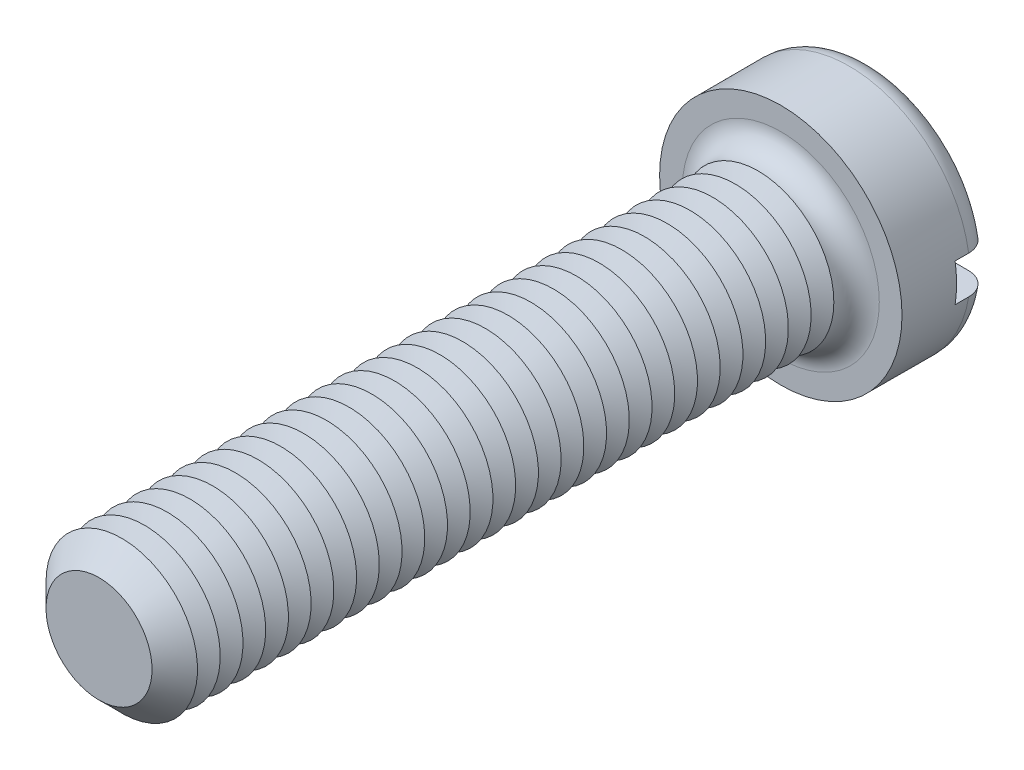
ISO-10303-21;
HEADER;
FILE_DESCRIPTION(('STEP AP214'),'2;1');
FILE_NAME('part.step','',(''),(''),'','','');
FILE_SCHEMA(('AUTOMOTIVE_DESIGN { 1 0 10303 214 1 1 1 1 }'));
ENDSEC;
DATA;
#1=APPLICATION_CONTEXT('core data for automotive mechanical design processes');
#2=APPLICATION_PROTOCOL_DEFINITION('international standard','automotive_design',2000,#1);
#3=PRODUCT_CONTEXT('',#1,'mechanical');
#4=PRODUCT('Part','Part','',(#3));
#5=PRODUCT_RELATED_PRODUCT_CATEGORY('part','',(#4));
#6=PRODUCT_DEFINITION_FORMATION('','',#4);
#7=PRODUCT_DEFINITION_CONTEXT('part definition',#1,'design');
#8=PRODUCT_DEFINITION('design','',#6,#7);
#9=PRODUCT_DEFINITION_SHAPE('','',#8);
#10=(LENGTH_UNIT() NAMED_UNIT(*) SI_UNIT(.MILLI.,.METRE.));
#11=(NAMED_UNIT(*) PLANE_ANGLE_UNIT() SI_UNIT($,.RADIAN.));
#12=(NAMED_UNIT(*) SI_UNIT($,.STERADIAN.) SOLID_ANGLE_UNIT());
#13=UNCERTAINTY_MEASURE_WITH_UNIT(LENGTH_MEASURE(1.E-05),#10,'distance_accuracy_value','');
#14=(GEOMETRIC_REPRESENTATION_CONTEXT(3) GLOBAL_UNCERTAINTY_ASSIGNED_CONTEXT((#13)) GLOBAL_UNIT_ASSIGNED_CONTEXT((#10,
#11,#12)) REPRESENTATION_CONTEXT('',''));
#15=CARTESIAN_POINT('',(0.,0.,0.));
#16=DIRECTION('',(0.,0.,1.));
#17=DIRECTION('',(1.,0.,0.));
#18=AXIS2_PLACEMENT_3D('',#15,#16,#17);
#19=CARTESIAN_POINT('',(0.,0.,-6.));
#20=DIRECTION('',(0.,0.,1.));
#21=DIRECTION('',(1.,0.,0.));
#22=AXIS2_PLACEMENT_3D('',#19,#20,#21);
#23=PLANE('',#22);
#24=CARTESIAN_POINT('',(0.,0.,-6.));
#25=DIRECTION('',(0.,0.,1.));
#26=DIRECTION('',(1.,0.,0.));
#27=AXIS2_PLACEMENT_3D('',#24,#25,#26);
#28=CIRCLE('',#27,6.5);
#29=CARTESIAN_POINT('',(-6.37867541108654,1.25,-6.));
#30=VERTEX_POINT('',#29);
#31=CARTESIAN_POINT('',(6.37867541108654,1.25,-6.));
#32=VERTEX_POINT('',#31);
#33=EDGE_CURVE('E116',#30,#32,#28,.F.);
#34=ORIENTED_EDGE('',*,*,#33,.T.);
#35=DIRECTION('',(1.,0.,0.));
#36=VECTOR('',#35,1.);
#37=CARTESIAN_POINT('',(-8.,1.25,-6.));
#38=LINE('',#37,#36);
#39=EDGE_CURVE('E111',#30,#32,#38,.T.);
#40=ORIENTED_EDGE('',*,*,#39,.F.);
#41=EDGE_LOOP('',(#34,#40));
#42=FACE_BOUND('',#41,.T.);
#43=ADVANCED_FACE('F39',(#42),#23,.F.);
#44=CARTESIAN_POINT('',(0.,0.,-4.5));
#45=DIRECTION('',(0.,0.,1.));
#46=DIRECTION('',(1.,0.,0.));
#47=AXIS2_PLACEMENT_3D('',#44,#45,#46);
#48=TOROIDAL_SURFACE('',#47,6.5,1.5);
#49=CARTESIAN_POINT('',(-7.63778128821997,1.25,-5.34492908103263));
#50=CARTESIAN_POINT('',(-7.58949199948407,1.25,-5.41482553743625));
#51=CARTESIAN_POINT('',(-7.53520056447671,1.25,-5.48065698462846));
#52=CARTESIAN_POINT('',(-7.41624971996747,1.25,-5.60228223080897));
#53=CARTESIAN_POINT('',(-7.35157642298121,1.25,-5.65806236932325));
#54=CARTESIAN_POINT('',(-7.21387612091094,1.25,-5.75795436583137));
#55=CARTESIAN_POINT('',(-7.14085828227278,1.25,-5.80207885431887));
#56=CARTESIAN_POINT('',(-6.98853766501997,1.25,-5.87758013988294));
#57=CARTESIAN_POINT('',(-6.90923642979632,1.25,-5.90896005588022));
#58=CARTESIAN_POINT('',(-6.74565677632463,1.25,-5.95849861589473));
#59=CARTESIAN_POINT('',(-6.66133328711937,1.25,-5.97650838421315));
#60=CARTESIAN_POINT('',(-6.49086565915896,1.25,-5.99833509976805));
#61=CARTESIAN_POINT('',(-6.40472129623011,1.25,-6.00215028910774));
#62=CARTESIAN_POINT('',(-6.23174891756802,1.25,-5.99550457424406));
#63=CARTESIAN_POINT('',(-6.14492874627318,1.25,-5.98483870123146));
#64=CARTESIAN_POINT('',(-5.97427268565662,1.25,-5.94920077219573));
#65=CARTESIAN_POINT('',(-5.89043699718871,1.25,-5.92422775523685));
#66=CARTESIAN_POINT('',(-5.72747580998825,1.25,-5.86041051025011));
#67=CARTESIAN_POINT('',(-5.64839123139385,1.25,-5.8214616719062));
#68=CARTESIAN_POINT('',(-5.49793182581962,1.25,-5.73076137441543));
#69=CARTESIAN_POINT('',(-5.42655700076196,1.25,-5.6790099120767));
#70=CARTESIAN_POINT('',(-5.29410028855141,1.25,-5.56444713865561));
#71=CARTESIAN_POINT('',(-5.23295591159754,1.25,-5.50170815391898));
#72=CARTESIAN_POINT('',(-5.12236155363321,1.25,-5.36664720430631));
#73=CARTESIAN_POINT('',(-5.07291010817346,1.25,-5.29432644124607));
#74=CARTESIAN_POINT('',(-4.98836421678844,1.25,-5.14389152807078));
#75=CARTESIAN_POINT('',(-4.95296843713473,1.25,-5.0659468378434));
#76=CARTESIAN_POINT('',(-4.89620356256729,1.25,-4.90510804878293));
#77=CARTESIAN_POINT('',(-4.87483169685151,1.25,-4.82221493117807));
#78=CARTESIAN_POINT('',(-4.8472995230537,1.25,-4.65636387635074));
#79=CARTESIAN_POINT('',(-4.84072446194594,1.25,-4.57347463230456));
#80=CARTESIAN_POINT('',(-4.84179430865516,1.25,-4.40779255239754));
#81=CARTESIAN_POINT('',(-4.84943782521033,1.25,-4.32499970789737));
#82=CARTESIAN_POINT('',(-4.87846819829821,1.25,-4.16301415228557));
#83=CARTESIAN_POINT('',(-4.89966978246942,1.25,-4.08378809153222));
#84=CARTESIAN_POINT('',(-4.95491528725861,1.25,-3.92995334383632));
#85=CARTESIAN_POINT('',(-4.98895983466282,1.25,-3.85534488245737));
#86=CARTESIAN_POINT('',(-5.06928242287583,1.25,-3.71183790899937));
#87=CARTESIAN_POINT('',(-5.11570495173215,1.25,-3.64302036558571));
#88=CARTESIAN_POINT('',(-5.21915370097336,1.25,-3.51388372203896));
#89=CARTESIAN_POINT('',(-5.27618132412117,1.25,-3.45356574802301));
#90=CARTESIAN_POINT('',(-5.40090076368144,1.25,-3.34137671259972));
#91=CARTESIAN_POINT('',(-5.46884305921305,1.25,-3.28978408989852));
#92=CARTESIAN_POINT('',(-5.61225757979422,1.25,-3.19841811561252));
#93=CARTESIAN_POINT('',(-5.68773079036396,1.25,-3.15864631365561));
#94=CARTESIAN_POINT('',(-5.84602026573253,1.25,-3.09111626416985));
#95=CARTESIAN_POINT('',(-5.92896901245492,1.25,-3.06366820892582));
#96=CARTESIAN_POINT('',(-6.09827849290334,1.25,-3.02294686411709));
#97=CARTESIAN_POINT('',(-6.18463944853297,1.25,-3.00967449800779));
#98=CARTESIAN_POINT('',(-6.35914138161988,1.25,-2.99765063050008));
#99=CARTESIAN_POINT('',(-6.4472913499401,1.25,-2.99902877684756));
#100=CARTESIAN_POINT('',(-6.62209547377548,1.25,-3.01665363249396));
#101=CARTESIAN_POINT('',(-6.70874965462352,1.25,-3.03290008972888));
#102=CARTESIAN_POINT('',(-6.87754008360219,1.25,-3.07975247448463));
#103=CARTESIAN_POINT('',(-6.95969991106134,1.25,-3.11027336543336));
#104=CARTESIAN_POINT('',(-7.11762200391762,1.25,-3.18486653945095));
#105=CARTESIAN_POINT('',(-7.19338469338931,1.25,-3.22893792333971));
#106=CARTESIAN_POINT('',(-7.33522754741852,1.25,-3.32873457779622));
#107=CARTESIAN_POINT('',(-7.40142768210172,1.25,-3.38428930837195));
#108=CARTESIAN_POINT('',(-7.52338344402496,1.25,-3.50587739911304));
#109=CARTESIAN_POINT('',(-7.5791399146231,1.25,-3.57190991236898));
#110=CARTESIAN_POINT('',(-7.67774856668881,1.25,-3.71151097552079));
#111=CARTESIAN_POINT('',(-7.72078137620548,1.25,-3.7849519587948));
#112=CARTESIAN_POINT('',(-7.79373860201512,1.25,-3.93807617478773));
#113=CARTESIAN_POINT('',(-7.82366445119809,1.25,-4.01775872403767));
#114=CARTESIAN_POINT('',(-7.86922494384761,1.25,-4.1801114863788));
#115=CARTESIAN_POINT('',(-7.88502105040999,1.25,-4.26273642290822));
#116=CARTESIAN_POINT('',(-7.90243332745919,1.25,-4.42948977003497));
#117=CARTESIAN_POINT('',(-7.90404643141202,1.25,-4.51361850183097));
#118=CARTESIAN_POINT('',(-7.89306914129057,1.25,-4.68049925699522));
#119=CARTESIAN_POINT('',(-7.88055163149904,1.25,-4.76325613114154));
#120=CARTESIAN_POINT('',(-7.84181179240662,1.25,-4.92542124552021));
#121=CARTESIAN_POINT('',(-7.81560657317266,1.25,-5.00483353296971));
#122=CARTESIAN_POINT('',(-7.76329893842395,1.25,-5.12766777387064));
#123=CARTESIAN_POINT('',(-7.74127773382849,1.25,-5.17287245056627));
#124=CARTESIAN_POINT('',(-7.69279783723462,1.25,-5.26083500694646));
#125=CARTESIAN_POINT('',(-7.66633917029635,1.25,-5.30359290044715));
#126=CARTESIAN_POINT('',(-7.63778128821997,1.25,-5.34492908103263));
#127=B_SPLINE_CURVE_WITH_KNOTS('',3,(#49,#50,#51,#52,#53,#54,#55,#56,#57,#58,#59,#60,#61,#62,
#63,#64,#65,#66,#67,#68,#69,#70,#71,#72,#73,#74,#75,#76,#77,#78,#79,#80,#81,#82,#83,#84,#85,#86,
#87,#88,#89,#90,#91,#92,#93,#94,#95,#96,#97,#98,#99,#100,#101,#102,#103,#104,#105,#106,#107,
#108,#109,#110,#111,#112,#113,#114,#115,#116,#117,#118,#119,#120,#121,#122,#123,#124,#125,#126),
.UNSPECIFIED.,.T.,.F.,(4,2,2,2,2,2,2,2,2,2,2,2,2,2,2,2,2,2,2,2,2,2,2,2,2,2,2,2,2,2,2,2,2,2,2,2,
2,2,4),(0.,0.254678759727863,0.509701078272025,0.764445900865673,1.01912834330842,
1.27660578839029,1.53411511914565,1.7953075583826,2.05651754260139,2.31972495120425,
2.58293242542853,2.84446831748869,3.10597143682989,3.36151874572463,3.61701554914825,
3.86525656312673,4.11347328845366,4.35836855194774,4.60327576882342,4.8511774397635,
5.0991119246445,5.35387584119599,5.60867314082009,5.86956650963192,6.13047687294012,
6.39369803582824,6.65691473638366,6.91858297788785,7.18023385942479,7.43824706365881,
7.69623942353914,7.95037087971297,8.20447454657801,8.45563599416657,8.70685174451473,
8.95677764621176,9.20639187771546,9.35700761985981,9.50762251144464),.UNSPECIFIED.);
#128=CARTESIAN_POINT('',(-7.90174031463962,1.25,-4.50000000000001));
#129=VERTEX_POINT('',#128);
#130=EDGE_CURVE('E403',#129,#30,#127,.T.);
#131=ORIENTED_EDGE('',*,*,#130,.F.);
#132=CARTESIAN_POINT('',(0.,0.,-4.5));
#133=DIRECTION('',(0.,0.,1.));
#134=DIRECTION('',(1.,0.,0.));
#135=AXIS2_PLACEMENT_3D('',#132,#133,#134);
#136=CIRCLE('',#135,8.);
#137=CARTESIAN_POINT('',(7.90174031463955,1.25,-4.5));
#138=VERTEX_POINT('',#137);
#139=EDGE_CURVE('E125',#138,#129,#136,.T.);
#140=ORIENTED_EDGE('',*,*,#139,.F.);
#141=CARTESIAN_POINT('',(4.95236709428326,1.25,-5.05808354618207));
#142=CARTESIAN_POINT('',(4.98477386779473,1.25,-5.13646278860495));
#143=CARTESIAN_POINT('',(5.02397623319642,1.25,-5.21210974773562));
#144=CARTESIAN_POINT('',(5.11464829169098,1.25,-5.35575180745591));
#145=CARTESIAN_POINT('',(5.16613670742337,1.25,-5.42373499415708));
#146=CARTESIAN_POINT('',(5.27963080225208,1.25,-5.55005899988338));
#147=CARTESIAN_POINT('',(5.34161871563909,1.25,-5.60841578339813));
#148=CARTESIAN_POINT('',(5.47431803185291,1.25,-5.71412381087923));
#149=CARTESIAN_POINT('',(5.545027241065,1.25,-5.76147781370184));
#150=CARTESIAN_POINT('',(5.69469818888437,1.25,-5.84486022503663));
#151=CARTESIAN_POINT('',(5.77379661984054,1.25,-5.88064336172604));
#152=CARTESIAN_POINT('',(5.93682776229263,1.25,-5.93863952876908));
#153=CARTESIAN_POINT('',(6.02076112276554,1.25,-5.96085073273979));
#154=CARTESIAN_POINT('',(6.19235911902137,1.25,-5.99130732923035));
#155=CARTESIAN_POINT('',(6.2800597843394,1.25,-5.99935025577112));
#156=CARTESIAN_POINT('',(6.45556807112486,1.25,-6.00057400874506));
#157=CARTESIAN_POINT('',(6.54337569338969,1.25,-5.99375472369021));
#158=CARTESIAN_POINT('',(6.71642471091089,1.25,-5.96539034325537));
#159=CARTESIAN_POINT('',(6.8016703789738,1.25,-5.94387137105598));
#160=CARTESIAN_POINT('',(6.96726399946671,1.25,-5.8866508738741));
#161=CARTESIAN_POINT('',(7.04761223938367,1.25,-5.85095018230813));
#162=CARTESIAN_POINT('',(7.2000703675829,1.25,-5.7668235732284));
#163=CARTESIAN_POINT('',(7.27226868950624,1.25,-5.71855796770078));
#164=CARTESIAN_POINT('',(7.40737382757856,1.25,-5.61041520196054));
#165=CARTESIAN_POINT('',(7.47028138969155,1.25,-5.55053897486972));
#166=CARTESIAN_POINT('',(7.5840004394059,1.25,-5.42185995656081));
#167=CARTESIAN_POINT('',(7.63498189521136,1.25,-5.35320736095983));
#168=CARTESIAN_POINT('',(7.72451646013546,1.25,-5.20822613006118));
#169=CARTESIAN_POINT('',(7.76307051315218,1.25,-5.13189807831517));
#170=CARTESIAN_POINT('',(7.82615156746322,1.25,-4.97479919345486));
#171=CARTESIAN_POINT('',(7.85085353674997,1.25,-4.89409858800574));
#172=CARTESIAN_POINT('',(7.88624162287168,1.25,-4.72968126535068));
#173=CARTESIAN_POINT('',(7.89692844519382,1.25,-4.64596470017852));
#174=CARTESIAN_POINT('',(7.90393395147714,1.25,-4.47857496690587));
#175=CARTESIAN_POINT('',(7.900361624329,1.25,-4.39490633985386));
#176=CARTESIAN_POINT('',(7.8792027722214,1.25,-4.22936201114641));
#177=CARTESIAN_POINT('',(7.86161649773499,1.25,-4.14748627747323));
#178=CARTESIAN_POINT('',(7.81298565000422,1.25,-3.98793539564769));
#179=CARTESIAN_POINT('',(7.78195585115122,1.25,-3.91025574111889));
#180=CARTESIAN_POINT('',(7.70736418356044,1.25,-3.76116938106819));
#181=CARTESIAN_POINT('',(7.66380211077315,1.25,-3.68976277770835));
#182=CARTESIAN_POINT('',(7.56515173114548,1.25,-3.55480889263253));
#183=CARTESIAN_POINT('',(7.51000119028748,1.25,-3.49130712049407));
#184=CARTESIAN_POINT('',(7.38992820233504,1.25,-3.3743390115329));
#185=CARTESIAN_POINT('',(7.32500529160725,1.25,-3.32087315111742));
#186=CARTESIAN_POINT('',(7.18646521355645,1.25,-3.22483712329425));
#187=CARTESIAN_POINT('',(7.11275872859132,1.25,-3.18239583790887));
#188=CARTESIAN_POINT('',(6.95934489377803,1.25,-3.11028530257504));
#189=CARTESIAN_POINT('',(6.87963710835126,1.25,-3.08061698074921));
#190=CARTESIAN_POINT('',(6.71523243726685,1.25,-3.03442872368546));
#191=CARTESIAN_POINT('',(6.63047940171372,1.25,-3.0181086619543));
#192=CARTESIAN_POINT('',(6.45944163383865,1.25,-2.99971307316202));
#193=CARTESIAN_POINT('',(6.37315677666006,1.25,-2.99763871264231));
#194=CARTESIAN_POINT('',(6.20021063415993,1.25,-3.00779604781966));
#195=CARTESIAN_POINT('',(6.11356117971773,1.25,-3.02022976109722));
#196=CARTESIAN_POINT('',(5.94354092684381,1.25,-3.05935975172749));
#197=CARTESIAN_POINT('',(5.86017035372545,1.25,-3.08605700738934));
#198=CARTESIAN_POINT('',(5.69848536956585,1.25,-3.15322746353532));
#199=CARTESIAN_POINT('',(5.62021039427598,1.25,-3.1937956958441));
#200=CARTESIAN_POINT('',(5.47164170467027,1.25,-3.28758816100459));
#201=CARTESIAN_POINT('',(5.40134797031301,1.25,-3.3408123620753));
#202=CARTESIAN_POINT('',(5.27136483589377,1.25,-3.45806317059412));
#203=CARTESIAN_POINT('',(5.21160120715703,1.25,-3.52200740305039));
#204=CARTESIAN_POINT('',(5.10396941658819,1.25,-3.65922833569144));
#205=CARTESIAN_POINT('',(5.05609917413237,1.25,-3.73250340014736));
#206=CARTESIAN_POINT('',(4.97487058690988,1.25,-3.8844714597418));
#207=CARTESIAN_POINT('',(4.94119529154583,1.25,-3.96299495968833));
#208=CARTESIAN_POINT('',(4.88793322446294,1.25,-4.12470694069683));
#209=CARTESIAN_POINT('',(4.86834741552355,1.25,-4.20789574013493));
#210=CARTESIAN_POINT('',(4.84433446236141,1.25,-4.3740749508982));
#211=CARTESIAN_POINT('',(4.83950391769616,1.25,-4.45700748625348));
#212=CARTESIAN_POINT('',(4.84404021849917,1.25,-4.62240731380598));
#213=CARTESIAN_POINT('',(4.85338770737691,1.25,-4.70487508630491));
#214=CARTESIAN_POINT('',(4.87895619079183,1.25,-4.83246978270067));
#215=CARTESIAN_POINT('',(4.89056704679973,1.25,-4.87856970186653));
#216=CARTESIAN_POINT('',(4.91819711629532,1.25,-4.96942661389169));
#217=CARTESIAN_POINT('',(4.93421619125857,1.25,-5.01418364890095));
#218=CARTESIAN_POINT('',(4.95236709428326,1.25,-5.05808354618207));
#219=B_SPLINE_CURVE_WITH_KNOTS('',3,(#141,#142,#143,#144,#145,#146,#147,#148,#149,#150,#151,
#152,#153,#154,#155,#156,#157,#158,#159,#160,#161,#162,#163,#164,#165,#166,#167,#168,#169,#170,
#171,#172,#173,#174,#175,#176,#177,#178,#179,#180,#181,#182,#183,#184,#185,#186,#187,#188,#189,
#190,#191,#192,#193,#194,#195,#196,#197,#198,#199,#200,#201,#202,#203,#204,#205,#206,#207,#208,
#209,#210,#211,#212,#213,#214,#215,#216,#217,#218),.UNSPECIFIED.,.T.,.F.,(4,2,2,2,2,2,2,2,2,2,2,
2,2,2,2,2,2,2,2,2,2,2,2,2,2,2,2,2,2,2,2,2,2,2,2,2,2,2,4),(0.,0.25426396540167,0.508917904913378,
0.763145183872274,1.01730864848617,1.27655188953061,1.53583000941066,1.79878406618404,
2.06174009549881,2.32423003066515,2.5867045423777,2.84598168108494,3.10523799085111,
3.36053725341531,3.61581712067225,3.8677953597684,4.11976091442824,4.36980428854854,
4.61984319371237,4.86960800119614,5.11937687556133,5.37052303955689,5.62168112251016,
5.87565515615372,6.12964764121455,6.38737709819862,6.64512765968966,6.90651052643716,
7.16791132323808,7.43114013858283,7.69436829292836,7.95565940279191,8.21690477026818,
8.47196060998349,8.72703387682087,8.97506819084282,9.22276418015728,9.36518087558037,
9.50759309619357),.UNSPECIFIED.);
#220=EDGE_CURVE('E405',#32,#138,#219,.T.);
#221=ORIENTED_EDGE('',*,*,#220,.F.);
#222=ORIENTED_EDGE('',*,*,#33,.F.);
#223=EDGE_LOOP('',(#131,#140,#221,#222));
#224=FACE_BOUND('',#223,.T.);
#225=ADVANCED_FACE('F387',(#224),#48,.T.);
#226=CARTESIAN_POINT('',(0.,0.,-6.));
#227=DIRECTION('',(0.,0.,1.));
#228=DIRECTION('',(1.,0.,0.));
#229=AXIS2_PLACEMENT_3D('',#226,#227,#228);
#230=CYLINDRICAL_SURFACE('',#229,8.);
#231=DIRECTION('',(0.,0.,1.));
#232=VECTOR('',#231,1.);
#233=CARTESIAN_POINT('',(7.90174031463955,1.25,-6.));
#234=LINE('',#233,#232);
#235=CARTESIAN_POINT('',(7.90174031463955,1.25,-3.6));
#236=VERTEX_POINT('',#235);
#237=EDGE_CURVE('E419',#138,#236,#234,.T.);
#238=ORIENTED_EDGE('',*,*,#237,.F.);
#239=ORIENTED_EDGE('',*,*,#139,.T.);
#240=DIRECTION('',(0.,0.,1.));
#241=VECTOR('',#240,1.);
#242=CARTESIAN_POINT('',(-7.90174031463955,1.25,-6.));
#243=LINE('',#242,#241);
#244=CARTESIAN_POINT('',(-7.90174031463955,1.25,-3.6));
#245=VERTEX_POINT('',#244);
#246=EDGE_CURVE('E63',#245,#129,#243,.F.);
#247=ORIENTED_EDGE('',*,*,#246,.F.);
#248=CARTESIAN_POINT('',(0.,0.,-3.6));
#249=DIRECTION('',(0.,0.,-1.));
#250=DIRECTION('',(-1.,0.,0.));
#251=AXIS2_PLACEMENT_3D('',#248,#249,#250);
#252=CIRCLE('',#251,8.);
#253=CARTESIAN_POINT('',(-7.90174031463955,-1.25,-3.6));
#254=VERTEX_POINT('',#253);
#255=EDGE_CURVE('E43',#245,#254,#252,.F.);
#256=ORIENTED_EDGE('',*,*,#255,.T.);
#257=DIRECTION('',(0.,0.,1.));
#258=VECTOR('',#257,1.);
#259=CARTESIAN_POINT('',(-7.90174031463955,-1.25,-6.));
#260=LINE('',#259,#258);
#261=CARTESIAN_POINT('',(-7.9017403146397,-1.25,-4.49999999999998));
#262=VERTEX_POINT('',#261);
#263=EDGE_CURVE('E417',#262,#254,#260,.T.);
#264=ORIENTED_EDGE('',*,*,#263,.F.);
#265=CARTESIAN_POINT('',(7.90174031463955,-1.25,-4.5));
#266=VERTEX_POINT('',#265);
#267=EDGE_CURVE('E127',#262,#266,#136,.T.);
#268=ORIENTED_EDGE('',*,*,#267,.T.);
#269=DIRECTION('',(0.,0.,1.));
#270=VECTOR('',#269,1.);
#271=CARTESIAN_POINT('',(7.90174031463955,-1.25,-6.));
#272=LINE('',#271,#270);
#273=CARTESIAN_POINT('',(7.90174031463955,-1.25,-3.6));
#274=VERTEX_POINT('',#273);
#275=EDGE_CURVE('E55',#274,#266,#272,.F.);
#276=ORIENTED_EDGE('',*,*,#275,.F.);
#277=EDGE_CURVE('E11',#274,#236,#252,.F.);
#278=ORIENTED_EDGE('',*,*,#277,.T.);
#279=EDGE_LOOP('',(#238,#239,#247,#256,#264,#268,#276,#278));
#280=FACE_BOUND('',#279,.T.);
#281=CARTESIAN_POINT('',(0.,0.,0.));
#282=DIRECTION('',(0.,0.,1.));
#283=DIRECTION('',(1.,0.,0.));
#284=AXIS2_PLACEMENT_3D('',#281,#282,#283);
#285=CIRCLE('',#284,8.);
#286=CARTESIAN_POINT('',(8.,0.,0.));
#287=VERTEX_POINT('',#286);
#288=EDGE_CURVE('E422',#287,#287,#285,.T.);
#289=ORIENTED_EDGE('',*,*,#288,.F.);
#290=EDGE_LOOP('',(#289));
#291=FACE_BOUND('',#290,.T.);
#292=ADVANCED_FACE('F383',(#280,#291),#230,.T.);
#293=CARTESIAN_POINT('',(6.37867541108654,-1.25,-6.));
#294=VERTEX_POINT('',#293);
#295=CARTESIAN_POINT('',(-6.37867541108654,-1.25,-6.));
#296=VERTEX_POINT('',#295);
#297=EDGE_CURVE('E109',#294,#296,#28,.F.);
#298=ORIENTED_EDGE('',*,*,#297,.T.);
#299=DIRECTION('',(-1.,0.,0.));
#300=VECTOR('',#299,1.);
#301=CARTESIAN_POINT('',(-8.,-1.25,-6.));
#302=LINE('',#301,#300);
#303=EDGE_CURVE('E96',#294,#296,#302,.T.);
#304=ORIENTED_EDGE('',*,*,#303,.F.);
#305=EDGE_LOOP('',(#298,#304));
#306=FACE_BOUND('',#305,.T.);
#307=ADVANCED_FACE('F108',(#306),#23,.F.);
#308=CARTESIAN_POINT('',(0.,0.,0.));
#309=DIRECTION('',(0.,0.,1.));
#310=DIRECTION('',(1.,0.,0.));
#311=AXIS2_PLACEMENT_3D('',#308,#309,#310);
#312=PLANE('',#311);
#313=CARTESIAN_POINT('',(0.,0.,0.));
#314=DIRECTION('',(0.,0.,1.));
#315=DIRECTION('',(1.,0.,0.));
#316=AXIS2_PLACEMENT_3D('',#313,#314,#315);
#317=CIRCLE('',#316,6.5);
#318=CARTESIAN_POINT('',(6.5,0.,0.));
#319=VERTEX_POINT('',#318);
#320=EDGE_CURVE('E115',#319,#319,#317,.F.);
#321=ORIENTED_EDGE('',*,*,#320,.T.);
#322=EDGE_LOOP('',(#321));
#323=FACE_BOUND('',#322,.T.);
#324=ORIENTED_EDGE('',*,*,#288,.T.);
#325=EDGE_LOOP('',(#324));
#326=FACE_BOUND('',#325,.T.);
#327=ADVANCED_FACE('F382',(#323,#326),#312,.T.);
#328=CARTESIAN_POINT('',(-7.63778128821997,-1.25,-5.34492908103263));
#329=CARTESIAN_POINT('',(-7.68527581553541,-1.25,-5.27616964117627));
#330=CARTESIAN_POINT('',(-7.72703224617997,-1.25,-5.20337764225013));
#331=CARTESIAN_POINT('',(-7.79778035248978,-1.25,-5.05176511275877));
#332=CARTESIAN_POINT('',(-7.82675823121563,-1.25,-4.97293817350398));
#333=CARTESIAN_POINT('',(-7.87103239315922,-1.25,-4.81153865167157));
#334=CARTESIAN_POINT('',(-7.8863313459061,-1.25,-4.72896680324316));
#335=CARTESIAN_POINT('',(-7.90278562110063,-1.25,-4.56244566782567));
#336=CARTESIAN_POINT('',(-7.90394420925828,-1.25,-4.4784967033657));
#337=CARTESIAN_POINT('',(-7.89211470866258,-1.25,-4.31190980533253));
#338=CARTESIAN_POINT('',(-7.87917806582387,-1.25,-4.22926821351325));
#339=CARTESIAN_POINT('',(-7.8396278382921,-1.25,-4.06732477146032));
#340=CARTESIAN_POINT('',(-7.81301388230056,-1.25,-3.98802301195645));
#341=CARTESIAN_POINT('',(-7.74686575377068,-1.25,-3.83490116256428));
#342=CARTESIAN_POINT('',(-7.70731700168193,-1.25,-3.76108737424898));
#343=CARTESIAN_POINT('',(-7.61647675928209,-1.25,-3.62108231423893));
#344=CARTESIAN_POINT('',(-7.56518496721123,-1.25,-3.55489123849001));
#345=CARTESIAN_POINT('',(-7.45192141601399,-1.25,-3.43145488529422));
#346=CARTESIAN_POINT('',(-7.3898717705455,-1.25,-3.37428109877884));
#347=CARTESIAN_POINT('',(-7.25715883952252,-1.25,-3.27100737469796));
#348=CARTESIAN_POINT('',(-7.18649507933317,-1.25,-3.22490804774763));
#349=CARTESIAN_POINT('',(-7.03760898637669,-1.25,-3.14445316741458));
#350=CARTESIAN_POINT('',(-6.95930204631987,-1.25,-3.1102542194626));
#351=CARTESIAN_POINT('',(-6.79811453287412,-1.25,-3.05526915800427));
#352=CARTESIAN_POINT('',(-6.71523359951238,-1.25,-3.03448410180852));
#353=CARTESIAN_POINT('',(-6.5459165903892,-1.25,-3.006592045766));
#354=CARTESIAN_POINT('',(-6.45944575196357,-1.25,-2.99969602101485));
#355=CARTESIAN_POINT('',(-6.28655568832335,-1.25,-3.00032465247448));
#356=CARTESIAN_POINT('',(-6.20013646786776,-1.25,-3.00785047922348));
#357=CARTESIAN_POINT('',(-6.02865505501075,-1.25,-3.03725742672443));
#358=CARTESIAN_POINT('',(-5.94362352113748,-1.25,-3.05931758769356));
#359=CARTESIAN_POINT('',(-5.77844448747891,-1.25,-3.11735373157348));
#360=CARTESIAN_POINT('',(-5.69829723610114,-1.25,-3.15333042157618));
#361=CARTESIAN_POINT('',(-5.54495924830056,-1.25,-3.23837037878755));
#362=CARTESIAN_POINT('',(-5.47178958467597,-1.25,-3.28747168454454));
#363=CARTESIAN_POINT('',(-5.33486536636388,-1.25,-3.39741183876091));
#364=CARTESIAN_POINT('',(-5.27111040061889,-1.25,-3.45825017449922));
#365=CARTESIAN_POINT('',(-5.15579778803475,-1.25,-3.58914722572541));
#366=CARTESIAN_POINT('',(-5.10409113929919,-1.25,-3.65907455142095));
#367=CARTESIAN_POINT('',(-5.01353659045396,-1.25,-3.8068142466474));
#368=CARTESIAN_POINT('',(-4.97468647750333,-1.25,-3.88462525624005));
#369=CARTESIAN_POINT('',(-4.91208858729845,-1.25,-4.04366636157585));
#370=CARTESIAN_POINT('',(-4.88795969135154,-1.25,-4.12474643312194));
#371=CARTESIAN_POINT('',(-4.85404909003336,-1.25,-4.28985038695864));
#372=CARTESIAN_POINT('',(-4.84426486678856,-1.25,-4.37387374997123));
#373=CARTESIAN_POINT('',(-4.83946276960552,-1.25,-4.54023897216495));
#374=CARTESIAN_POINT('',(-4.8440833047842,-1.25,-4.62257060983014));
#375=CARTESIAN_POINT('',(-4.86713763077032,-1.25,-4.78527148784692));
#376=CARTESIAN_POINT('',(-4.88557092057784,-1.25,-4.86564079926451));
#377=CARTESIAN_POINT('',(-4.9355229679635,-1.25,-5.02189555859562));
#378=CARTESIAN_POINT('',(-4.9669975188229,-1.25,-5.09779517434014));
#379=CARTESIAN_POINT('',(-5.04199393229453,-1.25,-5.24338322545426));
#380=CARTESIAN_POINT('',(-5.0855168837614,-1.25,-5.31307109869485));
#381=CARTESIAN_POINT('',(-5.18427540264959,-1.25,-5.44580979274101));
#382=CARTESIAN_POINT('',(-5.2397318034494,-1.25,-5.50869620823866));
#383=CARTESIAN_POINT('',(-5.36015301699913,-1.25,-5.62458635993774));
#384=CARTESIAN_POINT('',(-5.42511919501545,-1.25,-5.67758867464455));
#385=CARTESIAN_POINT('',(-5.56469412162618,-1.25,-5.7737610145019));
#386=CARTESIAN_POINT('',(-5.6395232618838,-1.25,-5.81661133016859));
#387=CARTESIAN_POINT('',(-5.79521544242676,-1.25,-5.8894110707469));
#388=CARTESIAN_POINT('',(-5.8760791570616,-1.25,-5.91935905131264));
#389=CARTESIAN_POINT('',(-6.04317815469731,-1.25,-5.9660059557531));
#390=CARTESIAN_POINT('',(-6.12948555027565,-1.25,-5.98244700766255));
#391=CARTESIAN_POINT('',(-6.30363462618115,-1.25,-6.00064866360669));
#392=CARTESIAN_POINT('',(-6.39147629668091,-1.25,-6.00240936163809));
#393=CARTESIAN_POINT('',(-6.5664192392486,-1.25,-5.9911248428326));
#394=CARTESIAN_POINT('',(-6.653518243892,-1.25,-5.9780442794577));
#395=CARTESIAN_POINT('',(-6.82426167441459,-1.25,-5.93729204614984));
#396=CARTESIAN_POINT('',(-6.90790538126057,-1.25,-5.90961735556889));
#397=CARTESIAN_POINT('',(-7.06846412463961,-1.25,-5.84071272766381));
#398=CARTESIAN_POINT('',(-7.14543542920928,-1.25,-5.79961377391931));
#399=CARTESIAN_POINT('',(-7.29116896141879,-1.25,-5.70491210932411));
#400=CARTESIAN_POINT('',(-7.35994165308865,-1.25,-5.65132560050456));
#401=CARTESIAN_POINT('',(-7.46362894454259,-1.25,-5.55509815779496));
#402=CARTESIAN_POINT('',(-7.50165191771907,-1.25,-5.51575032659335));
#403=CARTESIAN_POINT('',(-7.57319530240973,-1.25,-5.43315308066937));
#404=CARTESIAN_POINT('',(-7.60671575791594,-1.25,-5.38990370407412));
#405=CARTESIAN_POINT('',(-7.63778128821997,-1.25,-5.34492908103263));
#406=B_SPLINE_CURVE_WITH_KNOTS('',3,(#328,#329,#330,#331,#332,#333,#334,#335,#336,#337,#338,
#339,#340,#341,#342,#343,#344,#345,#346,#347,#348,#349,#350,#351,#352,#353,#354,#355,#356,#357,
#358,#359,#360,#361,#362,#363,#364,#365,#366,#367,#368,#369,#370,#371,#372,#373,#374,#375,#376,
#377,#378,#379,#380,#381,#382,#383,#384,#385,#386,#387,#388,#389,#390,#391,#392,#393,#394,#395,
#396,#397,#398,#399,#400,#401,#402,#403,#404,#405),.UNSPECIFIED.,.T.,.F.,(4,2,2,2,2,2,2,2,2,2,2,
2,2,2,2,2,2,2,2,2,2,2,2,2,2,2,2,2,2,2,2,2,2,2,2,2,2,2,4),(0.,0.250506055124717,
0.501281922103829,0.752008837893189,1.00267784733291,1.25243500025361,1.50219893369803,
1.75224536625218,2.00229822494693,2.25424343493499,2.50620253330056,2.76136198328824,
3.01654154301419,3.27556891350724,3.53461730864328,3.79691797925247,4.05923197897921,
4.32231463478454,4.5853858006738,4.84500678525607,5.10458306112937,5.3571172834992,
5.60960717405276,5.85581050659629,6.10200490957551,6.34737151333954,6.59276029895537,
6.84315522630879,7.09358613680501,7.35108485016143,7.60861238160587,7.87094926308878,
8.13328446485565,8.39624576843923,8.65926152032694,8.91978401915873,9.17997036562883,
9.34382460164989,9.50767723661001),.UNSPECIFIED.);
#407=EDGE_CURVE('E103',#296,#262,#406,.T.);
#408=ORIENTED_EDGE('',*,*,#407,.F.);
#409=ORIENTED_EDGE('',*,*,#297,.F.);
#410=CARTESIAN_POINT('',(4.95236709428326,-1.25,-5.05808354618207));
#411=CARTESIAN_POINT('',(4.92105512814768,-1.25,-4.98233216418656));
#412=CARTESIAN_POINT('',(4.89604361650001,-1.25,-4.90392040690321));
#413=CARTESIAN_POINT('',(4.85951223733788,-1.25,-4.74395758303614));
#414=CARTESIAN_POINT('',(4.8480045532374,-1.25,-4.66240375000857));
#415=CARTESIAN_POINT('',(4.83891469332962,-1.25,-4.49852199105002));
#416=CARTESIAN_POINT('',(4.84133145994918,-1.25,-4.41619412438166));
#417=CARTESIAN_POINT('',(4.8600038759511,-1.25,-4.25314313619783));
#418=CARTESIAN_POINT('',(4.87625705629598,-1.25,-4.17241973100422));
#419=CARTESIAN_POINT('',(4.92196554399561,-1.25,-4.01505032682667));
#420=CARTESIAN_POINT('',(4.95138456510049,-1.25,-3.93839376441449));
#421=CARTESIAN_POINT('',(5.02244158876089,-1.25,-3.79097367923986));
#422=CARTESIAN_POINT('',(5.06408092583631,-1.25,-3.72021080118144));
#423=CARTESIAN_POINT('',(5.15918188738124,-1.25,-3.5851203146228));
#424=CARTESIAN_POINT('',(5.21285223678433,-1.25,-3.5209397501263));
#425=CARTESIAN_POINT('',(5.32993512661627,-1.25,-3.40218700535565));
#426=CARTESIAN_POINT('',(5.39334903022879,-1.25,-3.34761617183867));
#427=CARTESIAN_POINT('',(5.5300552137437,-1.25,-3.24801679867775));
#428=CARTESIAN_POINT('',(5.60357647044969,-1.25,-3.20330242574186));
#429=CARTESIAN_POINT('',(5.75697062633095,-1.25,-3.1265687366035));
#430=CARTESIAN_POINT('',(5.83684424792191,-1.25,-3.09455086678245));
#431=CARTESIAN_POINT('',(6.00239031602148,-1.25,-3.04353393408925));
#432=CARTESIAN_POINT('',(6.08814636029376,-1.25,-3.02480570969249));
#433=CARTESIAN_POINT('',(6.26158564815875,-1.25,-3.00194915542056));
#434=CARTESIAN_POINT('',(6.34926896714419,-1.25,-2.997821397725));
#435=CARTESIAN_POINT('',(6.52441816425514,-1.25,-3.00435236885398));
#436=CARTESIAN_POINT('',(6.61188199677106,-1.25,-3.01506655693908));
#437=CARTESIAN_POINT('',(6.78373130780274,-1.25,-3.05116556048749));
#438=CARTESIAN_POINT('',(6.8681168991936,-1.25,-3.07654983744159));
#439=CARTESIAN_POINT('',(7.03056473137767,-1.25,-3.14105639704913));
#440=CARTESIAN_POINT('',(7.10867812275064,-1.25,-3.18004978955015));
#441=CARTESIAN_POINT('',(7.25711285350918,-1.25,-3.27078804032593));
#442=CARTESIAN_POINT('',(7.327434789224,-1.25,-3.32253192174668));
#443=CARTESIAN_POINT('',(7.45716954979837,-1.25,-3.4364775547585));
#444=CARTESIAN_POINT('',(7.51672925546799,-1.25,-3.49851206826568));
#445=CARTESIAN_POINT('',(7.62440498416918,-1.25,-3.63182557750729));
#446=CARTESIAN_POINT('',(7.67252193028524,-1.25,-3.70310382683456));
#447=CARTESIAN_POINT('',(7.75523498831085,-1.25,-3.8517825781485));
#448=CARTESIAN_POINT('',(7.79001407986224,-1.25,-3.92908131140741));
#449=CARTESIAN_POINT('',(7.84595474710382,-1.25,-4.08845836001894));
#450=CARTESIAN_POINT('',(7.86711715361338,-1.25,-4.1705363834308));
#451=CARTESIAN_POINT('',(7.89503817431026,-1.25,-4.3362768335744));
#452=CARTESIAN_POINT('',(7.90193595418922,-1.25,-4.41991584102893));
#453=CARTESIAN_POINT('',(7.90153623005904,-1.25,-4.58715860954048));
#454=CARTESIAN_POINT('',(7.89423915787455,-1.25,-4.67076237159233));
#455=CARTESIAN_POINT('',(7.86572271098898,-1.25,-4.83525080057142));
#456=CARTESIAN_POINT('',(7.84455307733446,-1.25,-4.91614410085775));
#457=CARTESIAN_POINT('',(7.78897430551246,-1.25,-5.0732444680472));
#458=CARTESIAN_POINT('',(7.75456511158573,-1.25,-5.1494515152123));
#459=CARTESIAN_POINT('',(7.67339923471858,-1.25,-5.29528903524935));
#460=CARTESIAN_POINT('',(7.62660424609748,-1.25,-5.36489817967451));
#461=CARTESIAN_POINT('',(7.52209201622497,-1.25,-5.49536318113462));
#462=CARTESIAN_POINT('',(7.4643743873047,-1.25,-5.55621872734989));
#463=CARTESIAN_POINT('',(7.33909994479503,-1.25,-5.66807257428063));
#464=CARTESIAN_POINT('',(7.27145672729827,-1.25,-5.71897407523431));
#465=CARTESIAN_POINT('',(7.12868060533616,-1.25,-5.80887807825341));
#466=CARTESIAN_POINT('',(7.0535472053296,-1.25,-5.84787979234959));
#467=CARTESIAN_POINT('',(6.89682225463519,-1.25,-5.91345911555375));
#468=CARTESIAN_POINT('',(6.81515596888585,-1.25,-5.93985808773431));
#469=CARTESIAN_POINT('',(6.64858434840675,-1.25,-5.97879449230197));
#470=CARTESIAN_POINT('',(6.56367874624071,-1.25,-5.99133077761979));
#471=CARTESIAN_POINT('',(6.39168259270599,-1.25,-6.00236627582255));
#472=CARTESIAN_POINT('',(6.30457835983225,-1.25,-6.00065255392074));
#473=CARTESIAN_POINT('',(6.13186422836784,-1.25,-5.98278857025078));
#474=CARTESIAN_POINT('',(6.04625438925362,-1.25,-5.96663773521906));
#475=CARTESIAN_POINT('',(5.87802521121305,-1.25,-5.92012173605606));
#476=CARTESIAN_POINT('',(5.79544617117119,-1.25,-5.88961066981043));
#477=CARTESIAN_POINT('',(5.63656223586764,-1.25,-5.81513349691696));
#478=CARTESIAN_POINT('',(5.56025908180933,-1.25,-5.77116367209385));
#479=CARTESIAN_POINT('',(5.4162607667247,-1.25,-5.67098882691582));
#480=CARTESIAN_POINT('',(5.34855795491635,-1.25,-5.61479480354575));
#481=CARTESIAN_POINT('',(5.22382615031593,-1.25,-5.49168804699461));
#482=CARTESIAN_POINT('',(5.16678340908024,-1.25,-5.42478932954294));
#483=CARTESIAN_POINT('',(5.08326589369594,-1.25,-5.3075481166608));
#484=CARTESIAN_POINT('',(5.05313168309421,-1.25,-5.25976959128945));
#485=CARTESIAN_POINT('',(4.99845900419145,-1.25,-5.16110869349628));
#486=CARTESIAN_POINT('',(4.9739204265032,-1.25,-5.11022638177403));
#487=CARTESIAN_POINT('',(4.95236709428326,-1.25,-5.05808354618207));
#488=B_SPLINE_CURVE_WITH_KNOTS('',3,(#410,#411,#412,#413,#414,#415,#416,#417,#418,#419,#420,
#421,#422,#423,#424,#425,#426,#427,#428,#429,#430,#431,#432,#433,#434,#435,#436,#437,#438,#439,
#440,#441,#442,#443,#444,#445,#446,#447,#448,#449,#450,#451,#452,#453,#454,#455,#456,#457,#458,
#459,#460,#461,#462,#463,#464,#465,#466,#467,#468,#469,#470,#471,#472,#473,#474,#475,#476,#477,
#478,#479,#480,#481,#482,#483,#484,#485,#486,#487),.UNSPECIFIED.,.T.,.F.,(4,2,2,2,2,2,2,2,2,2,2,
2,2,2,2,2,2,2,2,2,2,2,2,2,2,2,2,2,2,2,2,2,2,2,2,2,2,2,4),(0.,0.245701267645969,
0.491624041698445,0.737528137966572,0.983388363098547,1.22857510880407,1.47378864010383,
1.72364048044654,1.97352730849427,2.2304941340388,2.48749022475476,2.74958408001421,
3.01168820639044,3.2747743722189,3.53785088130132,3.79850056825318,4.05913029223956,
4.31587819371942,4.57260537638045,4.82567253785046,5.07872425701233,5.32929532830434,
5.57985877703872,5.82952869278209,6.07919966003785,6.32965199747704,6.58011322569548,
6.8329006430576,7.08570479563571,7.3419930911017,7.59830259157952,7.85844887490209,
8.11860548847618,8.38146435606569,8.64439590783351,8.90709189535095,9.16944670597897,
9.33857644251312,9.5077028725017),.UNSPECIFIED.);
#489=EDGE_CURVE('E92',#266,#294,#488,.T.);
#490=ORIENTED_EDGE('',*,*,#489,.F.);
#491=ORIENTED_EDGE('',*,*,#267,.F.);
#492=EDGE_LOOP('',(#408,#409,#490,#491));
#493=FACE_BOUND('',#492,.T.);
#494=ADVANCED_FACE('F113',(#493),#48,.T.);
#495=CARTESIAN_POINT('',(0.,0.,1.5));
#496=DIRECTION('',(0.,0.,1.));
#497=DIRECTION('',(1.,0.,0.));
#498=AXIS2_PLACEMENT_3D('',#495,#496,#497);
#499=TOROIDAL_SURFACE('',#498,6.5,1.5);
#500=ORIENTED_EDGE('',*,*,#320,.F.);
#501=EDGE_LOOP('',(#500));
#502=FACE_BOUND('',#501,.T.);
#503=CARTESIAN_POINT('',(0.,0.,1.5));
#504=DIRECTION('',(0.,0.,-1.));
#505=DIRECTION('',(-1.,0.,0.));
#506=AXIS2_PLACEMENT_3D('',#503,#504,#505);
#507=CIRCLE('',#506,5.);
#508=CARTESIAN_POINT('',(-5.,0.,1.5));
#509=VERTEX_POINT('',#508);
#510=EDGE_CURVE('E427',#509,#509,#507,.T.);
#511=ORIENTED_EDGE('',*,*,#510,.T.);
#512=EDGE_LOOP('',(#511));
#513=FACE_BOUND('',#512,.T.);
#514=ADVANCED_FACE('F375',(#502,#513),#499,.F.);
#515=CARTESIAN_POINT('',(0.,0.,2.25));
#516=DIRECTION('',(0.,0.,-1.));
#517=DIRECTION('',(-1.,0.,0.));
#518=AXIS2_PLACEMENT_3D('',#515,#516,#517);
#519=CONICAL_SURFACE('',#518,3.70096189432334,1.0471975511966);
#520=ORIENTED_EDGE('',*,*,#510,.F.);
#521=EDGE_LOOP('',(#520));
#522=FACE_BOUND('',#521,.T.);
#523=CARTESIAN_POINT('',(0.,0.,2.25));
#524=DIRECTION('',(0.,0.,-1.));
#525=DIRECTION('',(-1.,0.,0.));
#526=AXIS2_PLACEMENT_3D('',#523,#524,#525);
#527=CIRCLE('',#526,3.70096189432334);
#528=CARTESIAN_POINT('',(-3.70096189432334,0.,2.25));
#529=VERTEX_POINT('',#528);
#530=EDGE_CURVE('E432',#529,#529,#527,.T.);
#531=ORIENTED_EDGE('',*,*,#530,.T.);
#532=EDGE_LOOP('',(#531));
#533=FACE_BOUND('',#532,.T.);
#534=ADVANCED_FACE('F371',(#522,#533),#519,.T.);
#535=CARTESIAN_POINT('',(0.,0.,3.));
#536=DIRECTION('',(0.,0.,1.));
#537=DIRECTION('',(1.,0.,0.));
#538=AXIS2_PLACEMENT_3D('',#535,#536,#537);
#539=CONICAL_SURFACE('',#538,5.,1.0471975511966);
#540=ORIENTED_EDGE('',*,*,#530,.F.);
#541=EDGE_LOOP('',(#540));
#542=FACE_BOUND('',#541,.T.);
#543=CARTESIAN_POINT('',(0.,0.,3.));
#544=DIRECTION('',(0.,0.,-1.));
#545=DIRECTION('',(-1.,0.,0.));
#546=AXIS2_PLACEMENT_3D('',#543,#544,#545);
#547=CIRCLE('',#546,5.);
#548=CARTESIAN_POINT('',(-5.,0.,3.));
#549=VERTEX_POINT('',#548);
#550=EDGE_CURVE('E438',#549,#549,#547,.T.);
#551=ORIENTED_EDGE('',*,*,#550,.T.);
#552=EDGE_LOOP('',(#551));
#553=FACE_BOUND('',#552,.T.);
#554=ADVANCED_FACE('F367',(#542,#553),#539,.T.);
#555=CARTESIAN_POINT('',(0.,0.,3.75));
#556=DIRECTION('',(0.,0.,-1.));
#557=DIRECTION('',(-1.,0.,0.));
#558=AXIS2_PLACEMENT_3D('',#555,#556,#557);
#559=CONICAL_SURFACE('',#558,3.70096189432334,1.0471975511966);
#560=ORIENTED_EDGE('',*,*,#550,.F.);
#561=EDGE_LOOP('',(#560));
#562=FACE_BOUND('',#561,.T.);
#563=CARTESIAN_POINT('',(0.,0.,3.75));
#564=DIRECTION('',(0.,0.,-1.));
#565=DIRECTION('',(-1.,0.,0.));
#566=AXIS2_PLACEMENT_3D('',#563,#564,#565);
#567=CIRCLE('',#566,3.70096189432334);
#568=CARTESIAN_POINT('',(-3.70096189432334,0.,3.75));
#569=VERTEX_POINT('',#568);
#570=EDGE_CURVE('E442',#569,#569,#567,.T.);
#571=ORIENTED_EDGE('',*,*,#570,.T.);
#572=EDGE_LOOP('',(#571));
#573=FACE_BOUND('',#572,.T.);
#574=ADVANCED_FACE('F363',(#562,#573),#559,.T.);
#575=CARTESIAN_POINT('',(0.,0.,4.5));
#576=DIRECTION('',(0.,0.,1.));
#577=DIRECTION('',(1.,0.,0.));
#578=AXIS2_PLACEMENT_3D('',#575,#576,#577);
#579=CONICAL_SURFACE('',#578,5.,1.0471975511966);
#580=ORIENTED_EDGE('',*,*,#570,.F.);
#581=EDGE_LOOP('',(#580));
#582=FACE_BOUND('',#581,.T.);
#583=CARTESIAN_POINT('',(0.,0.,4.5));
#584=DIRECTION('',(0.,0.,-1.));
#585=DIRECTION('',(-1.,0.,0.));
#586=AXIS2_PLACEMENT_3D('',#583,#584,#585);
#587=CIRCLE('',#586,5.);
#588=CARTESIAN_POINT('',(-5.,0.,4.5));
#589=VERTEX_POINT('',#588);
#590=EDGE_CURVE('E446',#589,#589,#587,.T.);
#591=ORIENTED_EDGE('',*,*,#590,.T.);
#592=EDGE_LOOP('',(#591));
#593=FACE_BOUND('',#592,.T.);
#594=ADVANCED_FACE('F359',(#582,#593),#579,.T.);
#595=CARTESIAN_POINT('',(0.,0.,5.25));
#596=DIRECTION('',(0.,0.,-1.));
#597=DIRECTION('',(-1.,0.,0.));
#598=AXIS2_PLACEMENT_3D('',#595,#596,#597);
#599=CONICAL_SURFACE('',#598,3.70096189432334,1.0471975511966);
#600=ORIENTED_EDGE('',*,*,#590,.F.);
#601=EDGE_LOOP('',(#600));
#602=FACE_BOUND('',#601,.T.);
#603=CARTESIAN_POINT('',(0.,0.,5.25));
#604=DIRECTION('',(0.,0.,-1.));
#605=DIRECTION('',(-1.,0.,0.));
#606=AXIS2_PLACEMENT_3D('',#603,#604,#605);
#607=CIRCLE('',#606,3.70096189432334);
#608=CARTESIAN_POINT('',(-3.70096189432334,0.,5.25));
#609=VERTEX_POINT('',#608);
#610=EDGE_CURVE('E450',#609,#609,#607,.T.);
#611=ORIENTED_EDGE('',*,*,#610,.T.);
#612=EDGE_LOOP('',(#611));
#613=FACE_BOUND('',#612,.T.);
#614=ADVANCED_FACE('F355',(#602,#613),#599,.T.);
#615=CARTESIAN_POINT('',(0.,0.,6.));
#616=DIRECTION('',(0.,0.,1.));
#617=DIRECTION('',(1.,0.,0.));
#618=AXIS2_PLACEMENT_3D('',#615,#616,#617);
#619=CONICAL_SURFACE('',#618,5.,1.0471975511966);
#620=ORIENTED_EDGE('',*,*,#610,.F.);
#621=EDGE_LOOP('',(#620));
#622=FACE_BOUND('',#621,.T.);
#623=CARTESIAN_POINT('',(0.,0.,6.));
#624=DIRECTION('',(0.,0.,-1.));
#625=DIRECTION('',(-1.,0.,0.));
#626=AXIS2_PLACEMENT_3D('',#623,#624,#625);
#627=CIRCLE('',#626,5.);
#628=CARTESIAN_POINT('',(-5.,0.,6.));
#629=VERTEX_POINT('',#628);
#630=EDGE_CURVE('E454',#629,#629,#627,.T.);
#631=ORIENTED_EDGE('',*,*,#630,.T.);
#632=EDGE_LOOP('',(#631));
#633=FACE_BOUND('',#632,.T.);
#634=ADVANCED_FACE('F351',(#622,#633),#619,.T.);
#635=CARTESIAN_POINT('',(0.,0.,6.75));
#636=DIRECTION('',(0.,0.,-1.));
#637=DIRECTION('',(-1.,0.,0.));
#638=AXIS2_PLACEMENT_3D('',#635,#636,#637);
#639=CONICAL_SURFACE('',#638,3.70096189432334,1.0471975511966);
#640=ORIENTED_EDGE('',*,*,#630,.F.);
#641=EDGE_LOOP('',(#640));
#642=FACE_BOUND('',#641,.T.);
#643=CARTESIAN_POINT('',(0.,0.,6.75));
#644=DIRECTION('',(0.,0.,-1.));
#645=DIRECTION('',(-1.,0.,0.));
#646=AXIS2_PLACEMENT_3D('',#643,#644,#645);
#647=CIRCLE('',#646,3.70096189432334);
#648=CARTESIAN_POINT('',(-3.70096189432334,0.,6.75));
#649=VERTEX_POINT('',#648);
#650=EDGE_CURVE('E458',#649,#649,#647,.T.);
#651=ORIENTED_EDGE('',*,*,#650,.T.);
#652=EDGE_LOOP('',(#651));
#653=FACE_BOUND('',#652,.T.);
#654=ADVANCED_FACE('F347',(#642,#653),#639,.T.);
#655=CARTESIAN_POINT('',(0.,0.,7.5));
#656=DIRECTION('',(0.,0.,1.));
#657=DIRECTION('',(1.,0.,0.));
#658=AXIS2_PLACEMENT_3D('',#655,#656,#657);
#659=CONICAL_SURFACE('',#658,5.,1.0471975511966);
#660=ORIENTED_EDGE('',*,*,#650,.F.);
#661=EDGE_LOOP('',(#660));
#662=FACE_BOUND('',#661,.T.);
#663=CARTESIAN_POINT('',(0.,0.,7.5));
#664=DIRECTION('',(0.,0.,-1.));
#665=DIRECTION('',(-1.,0.,0.));
#666=AXIS2_PLACEMENT_3D('',#663,#664,#665);
#667=CIRCLE('',#666,5.);
#668=CARTESIAN_POINT('',(-5.,0.,7.5));
#669=VERTEX_POINT('',#668);
#670=EDGE_CURVE('E461',#669,#669,#667,.T.);
#671=ORIENTED_EDGE('',*,*,#670,.T.);
#672=EDGE_LOOP('',(#671));
#673=FACE_BOUND('',#672,.T.);
#674=ADVANCED_FACE('F343',(#662,#673),#659,.T.);
#675=CARTESIAN_POINT('',(0.,0.,8.25));
#676=DIRECTION('',(0.,0.,-1.));
#677=DIRECTION('',(-1.,0.,0.));
#678=AXIS2_PLACEMENT_3D('',#675,#676,#677);
#679=CONICAL_SURFACE('',#678,3.70096189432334,1.0471975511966);
#680=ORIENTED_EDGE('',*,*,#670,.F.);
#681=EDGE_LOOP('',(#680));
#682=FACE_BOUND('',#681,.T.);
#683=CARTESIAN_POINT('',(0.,0.,8.25));
#684=DIRECTION('',(0.,0.,-1.));
#685=DIRECTION('',(-1.,0.,0.));
#686=AXIS2_PLACEMENT_3D('',#683,#684,#685);
#687=CIRCLE('',#686,3.70096189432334);
#688=CARTESIAN_POINT('',(-3.70096189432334,0.,8.25));
#689=VERTEX_POINT('',#688);
#690=EDGE_CURVE('E465',#689,#689,#687,.T.);
#691=ORIENTED_EDGE('',*,*,#690,.T.);
#692=EDGE_LOOP('',(#691));
#693=FACE_BOUND('',#692,.T.);
#694=ADVANCED_FACE('F339',(#682,#693),#679,.T.);
#695=CARTESIAN_POINT('',(0.,0.,9.));
#696=DIRECTION('',(0.,0.,1.));
#697=DIRECTION('',(1.,0.,0.));
#698=AXIS2_PLACEMENT_3D('',#695,#696,#697);
#699=CONICAL_SURFACE('',#698,5.,1.0471975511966);
#700=ORIENTED_EDGE('',*,*,#690,.F.);
#701=EDGE_LOOP('',(#700));
#702=FACE_BOUND('',#701,.T.);
#703=CARTESIAN_POINT('',(0.,0.,9.));
#704=DIRECTION('',(0.,0.,-1.));
#705=DIRECTION('',(-1.,0.,0.));
#706=AXIS2_PLACEMENT_3D('',#703,#704,#705);
#707=CIRCLE('',#706,5.);
#708=CARTESIAN_POINT('',(-5.,0.,9.));
#709=VERTEX_POINT('',#708);
#710=EDGE_CURVE('E469',#709,#709,#707,.T.);
#711=ORIENTED_EDGE('',*,*,#710,.T.);
#712=EDGE_LOOP('',(#711));
#713=FACE_BOUND('',#712,.T.);
#714=ADVANCED_FACE('F335',(#702,#713),#699,.T.);
#715=CARTESIAN_POINT('',(0.,0.,9.75));
#716=DIRECTION('',(0.,0.,-1.));
#717=DIRECTION('',(-1.,0.,0.));
#718=AXIS2_PLACEMENT_3D('',#715,#716,#717);
#719=CONICAL_SURFACE('',#718,3.70096189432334,1.0471975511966);
#720=ORIENTED_EDGE('',*,*,#710,.F.);
#721=EDGE_LOOP('',(#720));
#722=FACE_BOUND('',#721,.T.);
#723=CARTESIAN_POINT('',(0.,0.,9.75));
#724=DIRECTION('',(0.,0.,-1.));
#725=DIRECTION('',(-1.,0.,0.));
#726=AXIS2_PLACEMENT_3D('',#723,#724,#725);
#727=CIRCLE('',#726,3.70096189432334);
#728=CARTESIAN_POINT('',(-3.70096189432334,0.,9.75));
#729=VERTEX_POINT('',#728);
#730=EDGE_CURVE('E473',#729,#729,#727,.T.);
#731=ORIENTED_EDGE('',*,*,#730,.T.);
#732=EDGE_LOOP('',(#731));
#733=FACE_BOUND('',#732,.T.);
#734=ADVANCED_FACE('F331',(#722,#733),#719,.T.);
#735=CARTESIAN_POINT('',(0.,0.,10.5));
#736=DIRECTION('',(0.,0.,1.));
#737=DIRECTION('',(1.,0.,0.));
#738=AXIS2_PLACEMENT_3D('',#735,#736,#737);
#739=CONICAL_SURFACE('',#738,5.,1.0471975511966);
#740=ORIENTED_EDGE('',*,*,#730,.F.);
#741=EDGE_LOOP('',(#740));
#742=FACE_BOUND('',#741,.T.);
#743=CARTESIAN_POINT('',(0.,0.,10.5));
#744=DIRECTION('',(0.,0.,-1.));
#745=DIRECTION('',(-1.,0.,0.));
#746=AXIS2_PLACEMENT_3D('',#743,#744,#745);
#747=CIRCLE('',#746,5.);
#748=CARTESIAN_POINT('',(-5.,0.,10.5));
#749=VERTEX_POINT('',#748);
#750=EDGE_CURVE('E477',#749,#749,#747,.T.);
#751=ORIENTED_EDGE('',*,*,#750,.T.);
#752=EDGE_LOOP('',(#751));
#753=FACE_BOUND('',#752,.T.);
#754=ADVANCED_FACE('F327',(#742,#753),#739,.T.);
#755=CARTESIAN_POINT('',(0.,0.,11.25));
#756=DIRECTION('',(0.,0.,-1.));
#757=DIRECTION('',(-1.,0.,0.));
#758=AXIS2_PLACEMENT_3D('',#755,#756,#757);
#759=CONICAL_SURFACE('',#758,3.70096189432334,1.0471975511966);
#760=ORIENTED_EDGE('',*,*,#750,.F.);
#761=EDGE_LOOP('',(#760));
#762=FACE_BOUND('',#761,.T.);
#763=CARTESIAN_POINT('',(0.,0.,11.25));
#764=DIRECTION('',(0.,0.,-1.));
#765=DIRECTION('',(-1.,0.,0.));
#766=AXIS2_PLACEMENT_3D('',#763,#764,#765);
#767=CIRCLE('',#766,3.70096189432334);
#768=CARTESIAN_POINT('',(-3.70096189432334,0.,11.25));
#769=VERTEX_POINT('',#768);
#770=EDGE_CURVE('E481',#769,#769,#767,.T.);
#771=ORIENTED_EDGE('',*,*,#770,.T.);
#772=EDGE_LOOP('',(#771));
#773=FACE_BOUND('',#772,.T.);
#774=ADVANCED_FACE('F323',(#762,#773),#759,.T.);
#775=CARTESIAN_POINT('',(0.,0.,12.));
#776=DIRECTION('',(0.,0.,1.));
#777=DIRECTION('',(1.,0.,0.));
#778=AXIS2_PLACEMENT_3D('',#775,#776,#777);
#779=CONICAL_SURFACE('',#778,5.,1.0471975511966);
#780=ORIENTED_EDGE('',*,*,#770,.F.);
#781=EDGE_LOOP('',(#780));
#782=FACE_BOUND('',#781,.T.);
#783=CARTESIAN_POINT('',(0.,0.,12.));
#784=DIRECTION('',(0.,0.,-1.));
#785=DIRECTION('',(-1.,0.,0.));
#786=AXIS2_PLACEMENT_3D('',#783,#784,#785);
#787=CIRCLE('',#786,5.);
#788=CARTESIAN_POINT('',(-5.,0.,12.));
#789=VERTEX_POINT('',#788);
#790=EDGE_CURVE('E485',#789,#789,#787,.T.);
#791=ORIENTED_EDGE('',*,*,#790,.T.);
#792=EDGE_LOOP('',(#791));
#793=FACE_BOUND('',#792,.T.);
#794=ADVANCED_FACE('F319',(#782,#793),#779,.T.);
#795=CARTESIAN_POINT('',(0.,0.,12.75));
#796=DIRECTION('',(0.,0.,-1.));
#797=DIRECTION('',(-1.,0.,0.));
#798=AXIS2_PLACEMENT_3D('',#795,#796,#797);
#799=CONICAL_SURFACE('',#798,3.70096189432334,1.0471975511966);
#800=ORIENTED_EDGE('',*,*,#790,.F.);
#801=EDGE_LOOP('',(#800));
#802=FACE_BOUND('',#801,.T.);
#803=CARTESIAN_POINT('',(0.,0.,12.75));
#804=DIRECTION('',(0.,0.,-1.));
#805=DIRECTION('',(-1.,0.,0.));
#806=AXIS2_PLACEMENT_3D('',#803,#804,#805);
#807=CIRCLE('',#806,3.70096189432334);
#808=CARTESIAN_POINT('',(-3.70096189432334,0.,12.75));
#809=VERTEX_POINT('',#808);
#810=EDGE_CURVE('E489',#809,#809,#807,.T.);
#811=ORIENTED_EDGE('',*,*,#810,.T.);
#812=EDGE_LOOP('',(#811));
#813=FACE_BOUND('',#812,.T.);
#814=ADVANCED_FACE('F315',(#802,#813),#799,.T.);
#815=CARTESIAN_POINT('',(0.,0.,13.5));
#816=DIRECTION('',(0.,0.,1.));
#817=DIRECTION('',(1.,0.,0.));
#818=AXIS2_PLACEMENT_3D('',#815,#816,#817);
#819=CONICAL_SURFACE('',#818,5.,1.0471975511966);
#820=ORIENTED_EDGE('',*,*,#810,.F.);
#821=EDGE_LOOP('',(#820));
#822=FACE_BOUND('',#821,.T.);
#823=CARTESIAN_POINT('',(0.,0.,13.5));
#824=DIRECTION('',(0.,0.,-1.));
#825=DIRECTION('',(-1.,0.,0.));
#826=AXIS2_PLACEMENT_3D('',#823,#824,#825);
#827=CIRCLE('',#826,5.);
#828=CARTESIAN_POINT('',(-5.,0.,13.5));
#829=VERTEX_POINT('',#828);
#830=EDGE_CURVE('E493',#829,#829,#827,.T.);
#831=ORIENTED_EDGE('',*,*,#830,.T.);
#832=EDGE_LOOP('',(#831));
#833=FACE_BOUND('',#832,.T.);
#834=ADVANCED_FACE('F311',(#822,#833),#819,.T.);
#835=CARTESIAN_POINT('',(0.,0.,14.25));
#836=DIRECTION('',(0.,0.,-1.));
#837=DIRECTION('',(-1.,0.,0.));
#838=AXIS2_PLACEMENT_3D('',#835,#836,#837);
#839=CONICAL_SURFACE('',#838,3.70096189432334,1.0471975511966);
#840=ORIENTED_EDGE('',*,*,#830,.F.);
#841=EDGE_LOOP('',(#840));
#842=FACE_BOUND('',#841,.T.);
#843=CARTESIAN_POINT('',(0.,0.,14.25));
#844=DIRECTION('',(0.,0.,-1.));
#845=DIRECTION('',(-1.,0.,0.));
#846=AXIS2_PLACEMENT_3D('',#843,#844,#845);
#847=CIRCLE('',#846,3.70096189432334);
#848=CARTESIAN_POINT('',(-3.70096189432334,0.,14.25));
#849=VERTEX_POINT('',#848);
#850=EDGE_CURVE('E497',#849,#849,#847,.T.);
#851=ORIENTED_EDGE('',*,*,#850,.T.);
#852=EDGE_LOOP('',(#851));
#853=FACE_BOUND('',#852,.T.);
#854=ADVANCED_FACE('F307',(#842,#853),#839,.T.);
#855=CARTESIAN_POINT('',(0.,0.,15.));
#856=DIRECTION('',(0.,0.,1.));
#857=DIRECTION('',(1.,0.,0.));
#858=AXIS2_PLACEMENT_3D('',#855,#856,#857);
#859=CONICAL_SURFACE('',#858,5.,1.0471975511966);
#860=ORIENTED_EDGE('',*,*,#850,.F.);
#861=EDGE_LOOP('',(#860));
#862=FACE_BOUND('',#861,.T.);
#863=CARTESIAN_POINT('',(0.,0.,15.));
#864=DIRECTION('',(0.,0.,-1.));
#865=DIRECTION('',(-1.,0.,0.));
#866=AXIS2_PLACEMENT_3D('',#863,#864,#865);
#867=CIRCLE('',#866,5.);
#868=CARTESIAN_POINT('',(-5.,0.,15.));
#869=VERTEX_POINT('',#868);
#870=EDGE_CURVE('E501',#869,#869,#867,.T.);
#871=ORIENTED_EDGE('',*,*,#870,.T.);
#872=EDGE_LOOP('',(#871));
#873=FACE_BOUND('',#872,.T.);
#874=ADVANCED_FACE('F303',(#862,#873),#859,.T.);
#875=CARTESIAN_POINT('',(0.,0.,15.75));
#876=DIRECTION('',(0.,0.,-1.));
#877=DIRECTION('',(-1.,0.,0.));
#878=AXIS2_PLACEMENT_3D('',#875,#876,#877);
#879=CONICAL_SURFACE('',#878,3.70096189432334,1.0471975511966);
#880=ORIENTED_EDGE('',*,*,#870,.F.);
#881=EDGE_LOOP('',(#880));
#882=FACE_BOUND('',#881,.T.);
#883=CARTESIAN_POINT('',(0.,0.,15.75));
#884=DIRECTION('',(0.,0.,-1.));
#885=DIRECTION('',(-1.,0.,0.));
#886=AXIS2_PLACEMENT_3D('',#883,#884,#885);
#887=CIRCLE('',#886,3.70096189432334);
#888=CARTESIAN_POINT('',(-3.70096189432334,0.,15.75));
#889=VERTEX_POINT('',#888);
#890=EDGE_CURVE('E505',#889,#889,#887,.T.);
#891=ORIENTED_EDGE('',*,*,#890,.T.);
#892=EDGE_LOOP('',(#891));
#893=FACE_BOUND('',#892,.T.);
#894=ADVANCED_FACE('F299',(#882,#893),#879,.T.);
#895=CARTESIAN_POINT('',(0.,0.,16.5));
#896=DIRECTION('',(0.,0.,1.));
#897=DIRECTION('',(1.,0.,0.));
#898=AXIS2_PLACEMENT_3D('',#895,#896,#897);
#899=CONICAL_SURFACE('',#898,5.,1.0471975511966);
#900=ORIENTED_EDGE('',*,*,#890,.F.);
#901=EDGE_LOOP('',(#900));
#902=FACE_BOUND('',#901,.T.);
#903=CARTESIAN_POINT('',(0.,0.,16.5));
#904=DIRECTION('',(0.,0.,-1.));
#905=DIRECTION('',(-1.,0.,0.));
#906=AXIS2_PLACEMENT_3D('',#903,#904,#905);
#907=CIRCLE('',#906,5.);
#908=CARTESIAN_POINT('',(-5.,0.,16.5));
#909=VERTEX_POINT('',#908);
#910=EDGE_CURVE('E508',#909,#909,#907,.T.);
#911=ORIENTED_EDGE('',*,*,#910,.T.);
#912=EDGE_LOOP('',(#911));
#913=FACE_BOUND('',#912,.T.);
#914=ADVANCED_FACE('F295',(#902,#913),#899,.T.);
#915=CARTESIAN_POINT('',(0.,0.,17.25));
#916=DIRECTION('',(0.,0.,-1.));
#917=DIRECTION('',(-1.,0.,0.));
#918=AXIS2_PLACEMENT_3D('',#915,#916,#917);
#919=CONICAL_SURFACE('',#918,3.70096189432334,1.0471975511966);
#920=ORIENTED_EDGE('',*,*,#910,.F.);
#921=EDGE_LOOP('',(#920));
#922=FACE_BOUND('',#921,.T.);
#923=CARTESIAN_POINT('',(0.,0.,17.25));
#924=DIRECTION('',(0.,0.,-1.));
#925=DIRECTION('',(-1.,0.,0.));
#926=AXIS2_PLACEMENT_3D('',#923,#924,#925);
#927=CIRCLE('',#926,3.70096189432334);
#928=CARTESIAN_POINT('',(-3.70096189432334,0.,17.25));
#929=VERTEX_POINT('',#928);
#930=EDGE_CURVE('E512',#929,#929,#927,.T.);
#931=ORIENTED_EDGE('',*,*,#930,.T.);
#932=EDGE_LOOP('',(#931));
#933=FACE_BOUND('',#932,.T.);
#934=ADVANCED_FACE('F291',(#922,#933),#919,.T.);
#935=CARTESIAN_POINT('',(0.,0.,18.));
#936=DIRECTION('',(0.,0.,1.));
#937=DIRECTION('',(1.,0.,0.));
#938=AXIS2_PLACEMENT_3D('',#935,#936,#937);
#939=CONICAL_SURFACE('',#938,5.,1.0471975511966);
#940=ORIENTED_EDGE('',*,*,#930,.F.);
#941=EDGE_LOOP('',(#940));
#942=FACE_BOUND('',#941,.T.);
#943=CARTESIAN_POINT('',(0.,0.,18.));
#944=DIRECTION('',(0.,0.,-1.));
#945=DIRECTION('',(-1.,0.,0.));
#946=AXIS2_PLACEMENT_3D('',#943,#944,#945);
#947=CIRCLE('',#946,5.);
#948=CARTESIAN_POINT('',(-5.,0.,18.));
#949=VERTEX_POINT('',#948);
#950=EDGE_CURVE('E516',#949,#949,#947,.T.);
#951=ORIENTED_EDGE('',*,*,#950,.T.);
#952=EDGE_LOOP('',(#951));
#953=FACE_BOUND('',#952,.T.);
#954=ADVANCED_FACE('F287',(#942,#953),#939,.T.);
#955=CARTESIAN_POINT('',(0.,0.,18.75));
#956=DIRECTION('',(0.,0.,-1.));
#957=DIRECTION('',(-1.,0.,0.));
#958=AXIS2_PLACEMENT_3D('',#955,#956,#957);
#959=CONICAL_SURFACE('',#958,3.70096189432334,1.0471975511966);
#960=ORIENTED_EDGE('',*,*,#950,.F.);
#961=EDGE_LOOP('',(#960));
#962=FACE_BOUND('',#961,.T.);
#963=CARTESIAN_POINT('',(0.,0.,18.75));
#964=DIRECTION('',(0.,0.,-1.));
#965=DIRECTION('',(-1.,0.,0.));
#966=AXIS2_PLACEMENT_3D('',#963,#964,#965);
#967=CIRCLE('',#966,3.70096189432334);
#968=CARTESIAN_POINT('',(-3.70096189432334,0.,18.75));
#969=VERTEX_POINT('',#968);
#970=EDGE_CURVE('E520',#969,#969,#967,.T.);
#971=ORIENTED_EDGE('',*,*,#970,.T.);
#972=EDGE_LOOP('',(#971));
#973=FACE_BOUND('',#972,.T.);
#974=ADVANCED_FACE('F283',(#962,#973),#959,.T.);
#975=CARTESIAN_POINT('',(0.,0.,19.5));
#976=DIRECTION('',(0.,0.,1.));
#977=DIRECTION('',(1.,0.,0.));
#978=AXIS2_PLACEMENT_3D('',#975,#976,#977);
#979=CONICAL_SURFACE('',#978,5.,1.0471975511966);
#980=ORIENTED_EDGE('',*,*,#970,.F.);
#981=EDGE_LOOP('',(#980));
#982=FACE_BOUND('',#981,.T.);
#983=CARTESIAN_POINT('',(0.,0.,19.5));
#984=DIRECTION('',(0.,0.,-1.));
#985=DIRECTION('',(-1.,0.,0.));
#986=AXIS2_PLACEMENT_3D('',#983,#984,#985);
#987=CIRCLE('',#986,5.);
#988=CARTESIAN_POINT('',(-5.,0.,19.5));
#989=VERTEX_POINT('',#988);
#990=EDGE_CURVE('E524',#989,#989,#987,.T.);
#991=ORIENTED_EDGE('',*,*,#990,.T.);
#992=EDGE_LOOP('',(#991));
#993=FACE_BOUND('',#992,.T.);
#994=ADVANCED_FACE('F279',(#982,#993),#979,.T.);
#995=CARTESIAN_POINT('',(0.,0.,20.25));
#996=DIRECTION('',(0.,0.,-1.));
#997=DIRECTION('',(-1.,0.,0.));
#998=AXIS2_PLACEMENT_3D('',#995,#996,#997);
#999=CONICAL_SURFACE('',#998,3.70096189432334,1.0471975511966);
#1000=ORIENTED_EDGE('',*,*,#990,.F.);
#1001=EDGE_LOOP('',(#1000));
#1002=FACE_BOUND('',#1001,.T.);
#1003=CARTESIAN_POINT('',(0.,0.,20.25));
#1004=DIRECTION('',(0.,0.,-1.));
#1005=DIRECTION('',(-1.,0.,0.));
#1006=AXIS2_PLACEMENT_3D('',#1003,#1004,#1005);
#1007=CIRCLE('',#1006,3.70096189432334);
#1008=CARTESIAN_POINT('',(-3.70096189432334,0.,20.25));
#1009=VERTEX_POINT('',#1008);
#1010=EDGE_CURVE('E528',#1009,#1009,#1007,.T.);
#1011=ORIENTED_EDGE('',*,*,#1010,.T.);
#1012=EDGE_LOOP('',(#1011));
#1013=FACE_BOUND('',#1012,.T.);
#1014=ADVANCED_FACE('F275',(#1002,#1013),#999,.T.);
#1015=CARTESIAN_POINT('',(0.,0.,21.));
#1016=DIRECTION('',(0.,0.,1.));
#1017=DIRECTION('',(1.,0.,0.));
#1018=AXIS2_PLACEMENT_3D('',#1015,#1016,#1017);
#1019=CONICAL_SURFACE('',#1018,5.,1.0471975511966);
#1020=ORIENTED_EDGE('',*,*,#1010,.F.);
#1021=EDGE_LOOP('',(#1020));
#1022=FACE_BOUND('',#1021,.T.);
#1023=CARTESIAN_POINT('',(0.,0.,21.));
#1024=DIRECTION('',(0.,0.,-1.));
#1025=DIRECTION('',(-1.,0.,0.));
#1026=AXIS2_PLACEMENT_3D('',#1023,#1024,#1025);
#1027=CIRCLE('',#1026,5.);
#1028=CARTESIAN_POINT('',(-5.,0.,21.));
#1029=VERTEX_POINT('',#1028);
#1030=EDGE_CURVE('E532',#1029,#1029,#1027,.T.);
#1031=ORIENTED_EDGE('',*,*,#1030,.T.);
#1032=EDGE_LOOP('',(#1031));
#1033=FACE_BOUND('',#1032,.T.);
#1034=ADVANCED_FACE('F271',(#1022,#1033),#1019,.T.);
#1035=CARTESIAN_POINT('',(0.,0.,21.75));
#1036=DIRECTION('',(0.,0.,-1.));
#1037=DIRECTION('',(-1.,0.,0.));
#1038=AXIS2_PLACEMENT_3D('',#1035,#1036,#1037);
#1039=CONICAL_SURFACE('',#1038,3.70096189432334,1.0471975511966);
#1040=ORIENTED_EDGE('',*,*,#1030,.F.);
#1041=EDGE_LOOP('',(#1040));
#1042=FACE_BOUND('',#1041,.T.);
#1043=CARTESIAN_POINT('',(0.,0.,21.75));
#1044=DIRECTION('',(0.,0.,-1.));
#1045=DIRECTION('',(-1.,0.,0.));
#1046=AXIS2_PLACEMENT_3D('',#1043,#1044,#1045);
#1047=CIRCLE('',#1046,3.70096189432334);
#1048=CARTESIAN_POINT('',(-3.70096189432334,0.,21.75));
#1049=VERTEX_POINT('',#1048);
#1050=EDGE_CURVE('E536',#1049,#1049,#1047,.T.);
#1051=ORIENTED_EDGE('',*,*,#1050,.T.);
#1052=EDGE_LOOP('',(#1051));
#1053=FACE_BOUND('',#1052,.T.);
#1054=ADVANCED_FACE('F267',(#1042,#1053),#1039,.T.);
#1055=CARTESIAN_POINT('',(0.,0.,22.5));
#1056=DIRECTION('',(0.,0.,1.));
#1057=DIRECTION('',(1.,0.,0.));
#1058=AXIS2_PLACEMENT_3D('',#1055,#1056,#1057);
#1059=CONICAL_SURFACE('',#1058,5.,1.0471975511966);
#1060=ORIENTED_EDGE('',*,*,#1050,.F.);
#1061=EDGE_LOOP('',(#1060));
#1062=FACE_BOUND('',#1061,.T.);
#1063=CARTESIAN_POINT('',(0.,0.,22.5));
#1064=DIRECTION('',(0.,0.,-1.));
#1065=DIRECTION('',(-1.,0.,0.));
#1066=AXIS2_PLACEMENT_3D('',#1063,#1064,#1065);
#1067=CIRCLE('',#1066,5.);
#1068=CARTESIAN_POINT('',(-5.,0.,22.5));
#1069=VERTEX_POINT('',#1068);
#1070=EDGE_CURVE('E540',#1069,#1069,#1067,.T.);
#1071=ORIENTED_EDGE('',*,*,#1070,.T.);
#1072=EDGE_LOOP('',(#1071));
#1073=FACE_BOUND('',#1072,.T.);
#1074=ADVANCED_FACE('F263',(#1062,#1073),#1059,.T.);
#1075=CARTESIAN_POINT('',(0.,0.,23.25));
#1076=DIRECTION('',(0.,0.,-1.));
#1077=DIRECTION('',(-1.,0.,0.));
#1078=AXIS2_PLACEMENT_3D('',#1075,#1076,#1077);
#1079=CONICAL_SURFACE('',#1078,3.70096189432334,1.0471975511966);
#1080=ORIENTED_EDGE('',*,*,#1070,.F.);
#1081=EDGE_LOOP('',(#1080));
#1082=FACE_BOUND('',#1081,.T.);
#1083=CARTESIAN_POINT('',(0.,0.,23.25));
#1084=DIRECTION('',(0.,0.,-1.));
#1085=DIRECTION('',(-1.,0.,0.));
#1086=AXIS2_PLACEMENT_3D('',#1083,#1084,#1085);
#1087=CIRCLE('',#1086,3.70096189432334);
#1088=CARTESIAN_POINT('',(-3.70096189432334,0.,23.25));
#1089=VERTEX_POINT('',#1088);
#1090=EDGE_CURVE('E544',#1089,#1089,#1087,.T.);
#1091=ORIENTED_EDGE('',*,*,#1090,.T.);
#1092=EDGE_LOOP('',(#1091));
#1093=FACE_BOUND('',#1092,.T.);
#1094=ADVANCED_FACE('F259',(#1082,#1093),#1079,.T.);
#1095=CARTESIAN_POINT('',(0.,0.,24.));
#1096=DIRECTION('',(0.,0.,1.));
#1097=DIRECTION('',(1.,0.,0.));
#1098=AXIS2_PLACEMENT_3D('',#1095,#1096,#1097);
#1099=CONICAL_SURFACE('',#1098,5.,1.0471975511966);
#1100=ORIENTED_EDGE('',*,*,#1090,.F.);
#1101=EDGE_LOOP('',(#1100));
#1102=FACE_BOUND('',#1101,.T.);
#1103=CARTESIAN_POINT('',(0.,0.,24.));
#1104=DIRECTION('',(0.,0.,-1.));
#1105=DIRECTION('',(-1.,0.,0.));
#1106=AXIS2_PLACEMENT_3D('',#1103,#1104,#1105);
#1107=CIRCLE('',#1106,5.);
#1108=CARTESIAN_POINT('',(-5.,0.,24.));
#1109=VERTEX_POINT('',#1108);
#1110=EDGE_CURVE('E548',#1109,#1109,#1107,.T.);
#1111=ORIENTED_EDGE('',*,*,#1110,.T.);
#1112=EDGE_LOOP('',(#1111));
#1113=FACE_BOUND('',#1112,.T.);
#1114=ADVANCED_FACE('F255',(#1102,#1113),#1099,.T.);
#1115=CARTESIAN_POINT('',(0.,0.,24.75));
#1116=DIRECTION('',(0.,0.,-1.));
#1117=DIRECTION('',(-1.,0.,0.));
#1118=AXIS2_PLACEMENT_3D('',#1115,#1116,#1117);
#1119=CONICAL_SURFACE('',#1118,3.70096189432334,1.0471975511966);
#1120=ORIENTED_EDGE('',*,*,#1110,.F.);
#1121=EDGE_LOOP('',(#1120));
#1122=FACE_BOUND('',#1121,.T.);
#1123=CARTESIAN_POINT('',(0.,0.,24.75));
#1124=DIRECTION('',(0.,0.,-1.));
#1125=DIRECTION('',(-1.,0.,0.));
#1126=AXIS2_PLACEMENT_3D('',#1123,#1124,#1125);
#1127=CIRCLE('',#1126,3.70096189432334);
#1128=CARTESIAN_POINT('',(-3.70096189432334,0.,24.75));
#1129=VERTEX_POINT('',#1128);
#1130=EDGE_CURVE('E552',#1129,#1129,#1127,.T.);
#1131=ORIENTED_EDGE('',*,*,#1130,.T.);
#1132=EDGE_LOOP('',(#1131));
#1133=FACE_BOUND('',#1132,.T.);
#1134=ADVANCED_FACE('F251',(#1122,#1133),#1119,.T.);
#1135=CARTESIAN_POINT('',(0.,0.,25.5));
#1136=DIRECTION('',(0.,0.,1.));
#1137=DIRECTION('',(1.,0.,0.));
#1138=AXIS2_PLACEMENT_3D('',#1135,#1136,#1137);
#1139=CONICAL_SURFACE('',#1138,5.,1.0471975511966);
#1140=ORIENTED_EDGE('',*,*,#1130,.F.);
#1141=EDGE_LOOP('',(#1140));
#1142=FACE_BOUND('',#1141,.T.);
#1143=CARTESIAN_POINT('',(0.,0.,25.5));
#1144=DIRECTION('',(0.,0.,-1.));
#1145=DIRECTION('',(-1.,0.,0.));
#1146=AXIS2_PLACEMENT_3D('',#1143,#1144,#1145);
#1147=CIRCLE('',#1146,5.);
#1148=CARTESIAN_POINT('',(-5.,0.,25.5));
#1149=VERTEX_POINT('',#1148);
#1150=EDGE_CURVE('E556',#1149,#1149,#1147,.T.);
#1151=ORIENTED_EDGE('',*,*,#1150,.T.);
#1152=EDGE_LOOP('',(#1151));
#1153=FACE_BOUND('',#1152,.T.);
#1154=ADVANCED_FACE('F247',(#1142,#1153),#1139,.T.);
#1155=CARTESIAN_POINT('',(0.,0.,26.25));
#1156=DIRECTION('',(0.,0.,-1.));
#1157=DIRECTION('',(-1.,0.,0.));
#1158=AXIS2_PLACEMENT_3D('',#1155,#1156,#1157);
#1159=CONICAL_SURFACE('',#1158,3.70096189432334,1.0471975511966);
#1160=ORIENTED_EDGE('',*,*,#1150,.F.);
#1161=EDGE_LOOP('',(#1160));
#1162=FACE_BOUND('',#1161,.T.);
#1163=CARTESIAN_POINT('',(0.,0.,26.25));
#1164=DIRECTION('',(0.,0.,-1.));
#1165=DIRECTION('',(-1.,0.,0.));
#1166=AXIS2_PLACEMENT_3D('',#1163,#1164,#1165);
#1167=CIRCLE('',#1166,3.70096189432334);
#1168=CARTESIAN_POINT('',(-3.70096189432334,0.,26.25));
#1169=VERTEX_POINT('',#1168);
#1170=EDGE_CURVE('E560',#1169,#1169,#1167,.T.);
#1171=ORIENTED_EDGE('',*,*,#1170,.T.);
#1172=EDGE_LOOP('',(#1171));
#1173=FACE_BOUND('',#1172,.T.);
#1174=ADVANCED_FACE('F243',(#1162,#1173),#1159,.T.);
#1175=CARTESIAN_POINT('',(0.,0.,27.));
#1176=DIRECTION('',(0.,0.,1.));
#1177=DIRECTION('',(1.,0.,0.));
#1178=AXIS2_PLACEMENT_3D('',#1175,#1176,#1177);
#1179=CONICAL_SURFACE('',#1178,5.,1.0471975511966);
#1180=ORIENTED_EDGE('',*,*,#1170,.F.);
#1181=EDGE_LOOP('',(#1180));
#1182=FACE_BOUND('',#1181,.T.);
#1183=CARTESIAN_POINT('',(0.,0.,27.));
#1184=DIRECTION('',(0.,0.,-1.));
#1185=DIRECTION('',(-1.,0.,0.));
#1186=AXIS2_PLACEMENT_3D('',#1183,#1184,#1185);
#1187=CIRCLE('',#1186,5.);
#1188=CARTESIAN_POINT('',(-5.,0.,27.));
#1189=VERTEX_POINT('',#1188);
#1190=EDGE_CURVE('E564',#1189,#1189,#1187,.T.);
#1191=ORIENTED_EDGE('',*,*,#1190,.T.);
#1192=EDGE_LOOP('',(#1191));
#1193=FACE_BOUND('',#1192,.T.);
#1194=ADVANCED_FACE('F239',(#1182,#1193),#1179,.T.);
#1195=CARTESIAN_POINT('',(0.,0.,27.75));
#1196=DIRECTION('',(0.,0.,-1.));
#1197=DIRECTION('',(-1.,0.,0.));
#1198=AXIS2_PLACEMENT_3D('',#1195,#1196,#1197);
#1199=CONICAL_SURFACE('',#1198,3.70096189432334,1.0471975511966);
#1200=ORIENTED_EDGE('',*,*,#1190,.F.);
#1201=EDGE_LOOP('',(#1200));
#1202=FACE_BOUND('',#1201,.T.);
#1203=CARTESIAN_POINT('',(0.,0.,27.75));
#1204=DIRECTION('',(0.,0.,-1.));
#1205=DIRECTION('',(-1.,0.,0.));
#1206=AXIS2_PLACEMENT_3D('',#1203,#1204,#1205);
#1207=CIRCLE('',#1206,3.70096189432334);
#1208=CARTESIAN_POINT('',(-3.70096189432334,0.,27.75));
#1209=VERTEX_POINT('',#1208);
#1210=EDGE_CURVE('E568',#1209,#1209,#1207,.T.);
#1211=ORIENTED_EDGE('',*,*,#1210,.T.);
#1212=EDGE_LOOP('',(#1211));
#1213=FACE_BOUND('',#1212,.T.);
#1214=ADVANCED_FACE('F235',(#1202,#1213),#1199,.T.);
#1215=CARTESIAN_POINT('',(0.,0.,28.5));
#1216=DIRECTION('',(0.,0.,1.));
#1217=DIRECTION('',(1.,0.,0.));
#1218=AXIS2_PLACEMENT_3D('',#1215,#1216,#1217);
#1219=CONICAL_SURFACE('',#1218,5.,1.0471975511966);
#1220=ORIENTED_EDGE('',*,*,#1210,.F.);
#1221=EDGE_LOOP('',(#1220));
#1222=FACE_BOUND('',#1221,.T.);
#1223=CARTESIAN_POINT('',(0.,0.,28.5));
#1224=DIRECTION('',(0.,0.,-1.));
#1225=DIRECTION('',(-1.,0.,0.));
#1226=AXIS2_PLACEMENT_3D('',#1223,#1224,#1225);
#1227=CIRCLE('',#1226,5.);
#1228=CARTESIAN_POINT('',(-5.,0.,28.5));
#1229=VERTEX_POINT('',#1228);
#1230=EDGE_CURVE('E572',#1229,#1229,#1227,.T.);
#1231=ORIENTED_EDGE('',*,*,#1230,.T.);
#1232=EDGE_LOOP('',(#1231));
#1233=FACE_BOUND('',#1232,.T.);
#1234=ADVANCED_FACE('F231',(#1222,#1233),#1219,.T.);
#1235=CARTESIAN_POINT('',(0.,0.,29.25));
#1236=DIRECTION('',(0.,0.,-1.));
#1237=DIRECTION('',(-1.,0.,0.));
#1238=AXIS2_PLACEMENT_3D('',#1235,#1236,#1237);
#1239=CONICAL_SURFACE('',#1238,3.70096189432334,1.0471975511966);
#1240=ORIENTED_EDGE('',*,*,#1230,.F.);
#1241=EDGE_LOOP('',(#1240));
#1242=FACE_BOUND('',#1241,.T.);
#1243=CARTESIAN_POINT('',(0.,0.,29.25));
#1244=DIRECTION('',(0.,0.,-1.));
#1245=DIRECTION('',(-1.,0.,0.));
#1246=AXIS2_PLACEMENT_3D('',#1243,#1244,#1245);
#1247=CIRCLE('',#1246,3.70096189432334);
#1248=CARTESIAN_POINT('',(-3.70096189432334,0.,29.25));
#1249=VERTEX_POINT('',#1248);
#1250=EDGE_CURVE('E576',#1249,#1249,#1247,.T.);
#1251=ORIENTED_EDGE('',*,*,#1250,.T.);
#1252=EDGE_LOOP('',(#1251));
#1253=FACE_BOUND('',#1252,.T.);
#1254=ADVANCED_FACE('F227',(#1242,#1253),#1239,.T.);
#1255=CARTESIAN_POINT('',(0.,0.,30.));
#1256=DIRECTION('',(0.,0.,1.));
#1257=DIRECTION('',(1.,0.,0.));
#1258=AXIS2_PLACEMENT_3D('',#1255,#1256,#1257);
#1259=CONICAL_SURFACE('',#1258,5.,1.0471975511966);
#1260=ORIENTED_EDGE('',*,*,#1250,.F.);
#1261=EDGE_LOOP('',(#1260));
#1262=FACE_BOUND('',#1261,.T.);
#1263=CARTESIAN_POINT('',(0.,0.,30.));
#1264=DIRECTION('',(0.,0.,-1.));
#1265=DIRECTION('',(-1.,0.,0.));
#1266=AXIS2_PLACEMENT_3D('',#1263,#1264,#1265);
#1267=CIRCLE('',#1266,5.);
#1268=CARTESIAN_POINT('',(-5.,0.,30.));
#1269=VERTEX_POINT('',#1268);
#1270=EDGE_CURVE('E580',#1269,#1269,#1267,.T.);
#1271=ORIENTED_EDGE('',*,*,#1270,.T.);
#1272=EDGE_LOOP('',(#1271));
#1273=FACE_BOUND('',#1272,.T.);
#1274=ADVANCED_FACE('F223',(#1262,#1273),#1259,.T.);
#1275=CARTESIAN_POINT('',(0.,0.,30.75));
#1276=DIRECTION('',(0.,0.,-1.));
#1277=DIRECTION('',(-1.,0.,0.));
#1278=AXIS2_PLACEMENT_3D('',#1275,#1276,#1277);
#1279=CONICAL_SURFACE('',#1278,3.70096189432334,1.0471975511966);
#1280=ORIENTED_EDGE('',*,*,#1270,.F.);
#1281=EDGE_LOOP('',(#1280));
#1282=FACE_BOUND('',#1281,.T.);
#1283=CARTESIAN_POINT('',(0.,0.,30.75));
#1284=DIRECTION('',(0.,0.,-1.));
#1285=DIRECTION('',(-1.,0.,0.));
#1286=AXIS2_PLACEMENT_3D('',#1283,#1284,#1285);
#1287=CIRCLE('',#1286,3.70096189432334);
#1288=CARTESIAN_POINT('',(-3.70096189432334,0.,30.75));
#1289=VERTEX_POINT('',#1288);
#1290=EDGE_CURVE('E584',#1289,#1289,#1287,.T.);
#1291=ORIENTED_EDGE('',*,*,#1290,.T.);
#1292=EDGE_LOOP('',(#1291));
#1293=FACE_BOUND('',#1292,.T.);
#1294=ADVANCED_FACE('F219',(#1282,#1293),#1279,.T.);
#1295=CARTESIAN_POINT('',(0.,0.,31.5));
#1296=DIRECTION('',(0.,0.,1.));
#1297=DIRECTION('',(1.,0.,0.));
#1298=AXIS2_PLACEMENT_3D('',#1295,#1296,#1297);
#1299=CONICAL_SURFACE('',#1298,5.,1.0471975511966);
#1300=ORIENTED_EDGE('',*,*,#1290,.F.);
#1301=EDGE_LOOP('',(#1300));
#1302=FACE_BOUND('',#1301,.T.);
#1303=CARTESIAN_POINT('',(0.,0.,31.5));
#1304=DIRECTION('',(0.,0.,-1.));
#1305=DIRECTION('',(-1.,0.,0.));
#1306=AXIS2_PLACEMENT_3D('',#1303,#1304,#1305);
#1307=CIRCLE('',#1306,5.);
#1308=CARTESIAN_POINT('',(-5.,0.,31.5));
#1309=VERTEX_POINT('',#1308);
#1310=EDGE_CURVE('E588',#1309,#1309,#1307,.T.);
#1311=ORIENTED_EDGE('',*,*,#1310,.T.);
#1312=EDGE_LOOP('',(#1311));
#1313=FACE_BOUND('',#1312,.T.);
#1314=ADVANCED_FACE('F215',(#1302,#1313),#1299,.T.);
#1315=CARTESIAN_POINT('',(0.,0.,32.25));
#1316=DIRECTION('',(0.,0.,-1.));
#1317=DIRECTION('',(-1.,0.,0.));
#1318=AXIS2_PLACEMENT_3D('',#1315,#1316,#1317);
#1319=CONICAL_SURFACE('',#1318,3.70096189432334,1.0471975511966);
#1320=ORIENTED_EDGE('',*,*,#1310,.F.);
#1321=EDGE_LOOP('',(#1320));
#1322=FACE_BOUND('',#1321,.T.);
#1323=CARTESIAN_POINT('',(0.,0.,32.25));
#1324=DIRECTION('',(0.,0.,-1.));
#1325=DIRECTION('',(-1.,0.,0.));
#1326=AXIS2_PLACEMENT_3D('',#1323,#1324,#1325);
#1327=CIRCLE('',#1326,3.70096189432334);
#1328=CARTESIAN_POINT('',(-3.70096189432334,0.,32.25));
#1329=VERTEX_POINT('',#1328);
#1330=EDGE_CURVE('E592',#1329,#1329,#1327,.T.);
#1331=ORIENTED_EDGE('',*,*,#1330,.T.);
#1332=EDGE_LOOP('',(#1331));
#1333=FACE_BOUND('',#1332,.T.);
#1334=ADVANCED_FACE('F211',(#1322,#1333),#1319,.T.);
#1335=CARTESIAN_POINT('',(0.,0.,33.));
#1336=DIRECTION('',(0.,0.,1.));
#1337=DIRECTION('',(1.,0.,0.));
#1338=AXIS2_PLACEMENT_3D('',#1335,#1336,#1337);
#1339=CONICAL_SURFACE('',#1338,5.,1.0471975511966);
#1340=ORIENTED_EDGE('',*,*,#1330,.F.);
#1341=EDGE_LOOP('',(#1340));
#1342=FACE_BOUND('',#1341,.T.);
#1343=CARTESIAN_POINT('',(0.,0.,33.));
#1344=DIRECTION('',(0.,0.,-1.));
#1345=DIRECTION('',(-1.,0.,0.));
#1346=AXIS2_PLACEMENT_3D('',#1343,#1344,#1345);
#1347=CIRCLE('',#1346,5.);
#1348=CARTESIAN_POINT('',(-5.,0.,33.));
#1349=VERTEX_POINT('',#1348);
#1350=EDGE_CURVE('E596',#1349,#1349,#1347,.T.);
#1351=ORIENTED_EDGE('',*,*,#1350,.T.);
#1352=EDGE_LOOP('',(#1351));
#1353=FACE_BOUND('',#1352,.T.);
#1354=ADVANCED_FACE('F207',(#1342,#1353),#1339,.T.);
#1355=CARTESIAN_POINT('',(0.,0.,33.75));
#1356=DIRECTION('',(0.,0.,-1.));
#1357=DIRECTION('',(-1.,0.,0.));
#1358=AXIS2_PLACEMENT_3D('',#1355,#1356,#1357);
#1359=CONICAL_SURFACE('',#1358,3.70096189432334,1.0471975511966);
#1360=ORIENTED_EDGE('',*,*,#1350,.F.);
#1361=EDGE_LOOP('',(#1360));
#1362=FACE_BOUND('',#1361,.T.);
#1363=CARTESIAN_POINT('',(0.,0.,33.75));
#1364=DIRECTION('',(0.,0.,-1.));
#1365=DIRECTION('',(-1.,0.,0.));
#1366=AXIS2_PLACEMENT_3D('',#1363,#1364,#1365);
#1367=CIRCLE('',#1366,3.70096189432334);
#1368=CARTESIAN_POINT('',(-3.70096189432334,0.,33.75));
#1369=VERTEX_POINT('',#1368);
#1370=EDGE_CURVE('E600',#1369,#1369,#1367,.T.);
#1371=ORIENTED_EDGE('',*,*,#1370,.T.);
#1372=EDGE_LOOP('',(#1371));
#1373=FACE_BOUND('',#1372,.T.);
#1374=ADVANCED_FACE('F203',(#1362,#1373),#1359,.T.);
#1375=CARTESIAN_POINT('',(0.,0.,34.5));
#1376=DIRECTION('',(0.,0.,1.));
#1377=DIRECTION('',(1.,0.,0.));
#1378=AXIS2_PLACEMENT_3D('',#1375,#1376,#1377);
#1379=CONICAL_SURFACE('',#1378,5.,1.0471975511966);
#1380=ORIENTED_EDGE('',*,*,#1370,.F.);
#1381=EDGE_LOOP('',(#1380));
#1382=FACE_BOUND('',#1381,.T.);
#1383=CARTESIAN_POINT('',(0.,0.,34.5));
#1384=DIRECTION('',(0.,0.,-1.));
#1385=DIRECTION('',(-1.,0.,0.));
#1386=AXIS2_PLACEMENT_3D('',#1383,#1384,#1385);
#1387=CIRCLE('',#1386,5.);
#1388=CARTESIAN_POINT('',(-5.,0.,34.5));
#1389=VERTEX_POINT('',#1388);
#1390=EDGE_CURVE('E604',#1389,#1389,#1387,.T.);
#1391=ORIENTED_EDGE('',*,*,#1390,.T.);
#1392=EDGE_LOOP('',(#1391));
#1393=FACE_BOUND('',#1392,.T.);
#1394=ADVANCED_FACE('F199',(#1382,#1393),#1379,.T.);
#1395=CARTESIAN_POINT('',(0.,0.,35.25));
#1396=DIRECTION('',(0.,0.,-1.));
#1397=DIRECTION('',(-1.,0.,0.));
#1398=AXIS2_PLACEMENT_3D('',#1395,#1396,#1397);
#1399=CONICAL_SURFACE('',#1398,3.70096189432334,1.0471975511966);
#1400=ORIENTED_EDGE('',*,*,#1390,.F.);
#1401=EDGE_LOOP('',(#1400));
#1402=FACE_BOUND('',#1401,.T.);
#1403=CARTESIAN_POINT('',(0.,0.,35.25));
#1404=DIRECTION('',(0.,0.,-1.));
#1405=DIRECTION('',(-1.,0.,0.));
#1406=AXIS2_PLACEMENT_3D('',#1403,#1404,#1405);
#1407=CIRCLE('',#1406,3.70096189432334);
#1408=CARTESIAN_POINT('',(-3.70096189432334,0.,35.25));
#1409=VERTEX_POINT('',#1408);
#1410=EDGE_CURVE('E608',#1409,#1409,#1407,.T.);
#1411=ORIENTED_EDGE('',*,*,#1410,.T.);
#1412=EDGE_LOOP('',(#1411));
#1413=FACE_BOUND('',#1412,.T.);
#1414=ADVANCED_FACE('F195',(#1402,#1413),#1399,.T.);
#1415=CARTESIAN_POINT('',(0.,0.,36.));
#1416=DIRECTION('',(0.,0.,1.));
#1417=DIRECTION('',(1.,0.,0.));
#1418=AXIS2_PLACEMENT_3D('',#1415,#1416,#1417);
#1419=CONICAL_SURFACE('',#1418,5.,1.0471975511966);
#1420=ORIENTED_EDGE('',*,*,#1410,.F.);
#1421=EDGE_LOOP('',(#1420));
#1422=FACE_BOUND('',#1421,.T.);
#1423=CARTESIAN_POINT('',(0.,0.,36.));
#1424=DIRECTION('',(0.,0.,-1.));
#1425=DIRECTION('',(-1.,0.,0.));
#1426=AXIS2_PLACEMENT_3D('',#1423,#1424,#1425);
#1427=CIRCLE('',#1426,5.);
#1428=CARTESIAN_POINT('',(-5.,0.,36.));
#1429=VERTEX_POINT('',#1428);
#1430=EDGE_CURVE('E612',#1429,#1429,#1427,.T.);
#1431=ORIENTED_EDGE('',*,*,#1430,.T.);
#1432=EDGE_LOOP('',(#1431));
#1433=FACE_BOUND('',#1432,.T.);
#1434=ADVANCED_FACE('F191',(#1422,#1433),#1419,.T.);
#1435=CARTESIAN_POINT('',(0.,0.,36.75));
#1436=DIRECTION('',(0.,0.,-1.));
#1437=DIRECTION('',(-1.,0.,0.));
#1438=AXIS2_PLACEMENT_3D('',#1435,#1436,#1437);
#1439=CONICAL_SURFACE('',#1438,3.70096189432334,1.0471975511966);
#1440=ORIENTED_EDGE('',*,*,#1430,.F.);
#1441=EDGE_LOOP('',(#1440));
#1442=FACE_BOUND('',#1441,.T.);
#1443=CARTESIAN_POINT('',(0.,0.,36.75));
#1444=DIRECTION('',(0.,0.,-1.));
#1445=DIRECTION('',(-1.,0.,0.));
#1446=AXIS2_PLACEMENT_3D('',#1443,#1444,#1445);
#1447=CIRCLE('',#1446,3.70096189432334);
#1448=CARTESIAN_POINT('',(-3.70096189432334,0.,36.75));
#1449=VERTEX_POINT('',#1448);
#1450=EDGE_CURVE('E616',#1449,#1449,#1447,.T.);
#1451=ORIENTED_EDGE('',*,*,#1450,.T.);
#1452=EDGE_LOOP('',(#1451));
#1453=FACE_BOUND('',#1452,.T.);
#1454=ADVANCED_FACE('F187',(#1442,#1453),#1439,.T.);
#1455=CARTESIAN_POINT('',(0.,0.,37.5));
#1456=DIRECTION('',(0.,0.,1.));
#1457=DIRECTION('',(1.,0.,0.));
#1458=AXIS2_PLACEMENT_3D('',#1455,#1456,#1457);
#1459=CONICAL_SURFACE('',#1458,5.,1.0471975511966);
#1460=ORIENTED_EDGE('',*,*,#1450,.F.);
#1461=EDGE_LOOP('',(#1460));
#1462=FACE_BOUND('',#1461,.T.);
#1463=CARTESIAN_POINT('',(0.,0.,37.5));
#1464=DIRECTION('',(0.,0.,-1.));
#1465=DIRECTION('',(-1.,0.,0.));
#1466=AXIS2_PLACEMENT_3D('',#1463,#1464,#1465);
#1467=CIRCLE('',#1466,5.);
#1468=CARTESIAN_POINT('',(-5.,0.,37.5));
#1469=VERTEX_POINT('',#1468);
#1470=EDGE_CURVE('E620',#1469,#1469,#1467,.T.);
#1471=ORIENTED_EDGE('',*,*,#1470,.T.);
#1472=EDGE_LOOP('',(#1471));
#1473=FACE_BOUND('',#1472,.T.);
#1474=ADVANCED_FACE('F183',(#1462,#1473),#1459,.T.);
#1475=CARTESIAN_POINT('',(0.,0.,38.25));
#1476=DIRECTION('',(0.,0.,-1.));
#1477=DIRECTION('',(-1.,0.,0.));
#1478=AXIS2_PLACEMENT_3D('',#1475,#1476,#1477);
#1479=CONICAL_SURFACE('',#1478,3.70096189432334,1.0471975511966);
#1480=ORIENTED_EDGE('',*,*,#1470,.F.);
#1481=EDGE_LOOP('',(#1480));
#1482=FACE_BOUND('',#1481,.T.);
#1483=CARTESIAN_POINT('',(0.,0.,38.25));
#1484=DIRECTION('',(0.,0.,-1.));
#1485=DIRECTION('',(-1.,0.,0.));
#1486=AXIS2_PLACEMENT_3D('',#1483,#1484,#1485);
#1487=CIRCLE('',#1486,3.70096189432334);
#1488=CARTESIAN_POINT('',(-3.70096189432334,0.,38.25));
#1489=VERTEX_POINT('',#1488);
#1490=EDGE_CURVE('E624',#1489,#1489,#1487,.T.);
#1491=ORIENTED_EDGE('',*,*,#1490,.T.);
#1492=EDGE_LOOP('',(#1491));
#1493=FACE_BOUND('',#1492,.T.);
#1494=ADVANCED_FACE('F179',(#1482,#1493),#1479,.T.);
#1495=CARTESIAN_POINT('',(0.,0.,39.));
#1496=DIRECTION('',(0.,0.,1.));
#1497=DIRECTION('',(1.,0.,0.));
#1498=AXIS2_PLACEMENT_3D('',#1495,#1496,#1497);
#1499=CONICAL_SURFACE('',#1498,5.,1.0471975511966);
#1500=ORIENTED_EDGE('',*,*,#1490,.F.);
#1501=EDGE_LOOP('',(#1500));
#1502=FACE_BOUND('',#1501,.T.);
#1503=CARTESIAN_POINT('',(0.,0.,39.));
#1504=DIRECTION('',(0.,0.,-1.));
#1505=DIRECTION('',(-1.,0.,0.));
#1506=AXIS2_PLACEMENT_3D('',#1503,#1504,#1505);
#1507=CIRCLE('',#1506,5.);
#1508=CARTESIAN_POINT('',(-5.,0.,39.));
#1509=VERTEX_POINT('',#1508);
#1510=EDGE_CURVE('E627',#1509,#1509,#1507,.T.);
#1511=ORIENTED_EDGE('',*,*,#1510,.T.);
#1512=EDGE_LOOP('',(#1511));
#1513=FACE_BOUND('',#1512,.T.);
#1514=ADVANCED_FACE('F175',(#1502,#1513),#1499,.T.);
#1515=CARTESIAN_POINT('',(0.,0.,39.75));
#1516=DIRECTION('',(0.,0.,-1.));
#1517=DIRECTION('',(-1.,0.,0.));
#1518=AXIS2_PLACEMENT_3D('',#1515,#1516,#1517);
#1519=CONICAL_SURFACE('',#1518,3.70096189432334,1.0471975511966);
#1520=ORIENTED_EDGE('',*,*,#1510,.F.);
#1521=EDGE_LOOP('',(#1520));
#1522=FACE_BOUND('',#1521,.T.);
#1523=CARTESIAN_POINT('',(0.,0.,39.75));
#1524=DIRECTION('',(0.,0.,-1.));
#1525=DIRECTION('',(-1.,0.,0.));
#1526=AXIS2_PLACEMENT_3D('',#1523,#1524,#1525);
#1527=CIRCLE('',#1526,3.70096189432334);
#1528=CARTESIAN_POINT('',(-3.70096189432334,0.,39.75));
#1529=VERTEX_POINT('',#1528);
#1530=EDGE_CURVE('E631',#1529,#1529,#1527,.T.);
#1531=ORIENTED_EDGE('',*,*,#1530,.T.);
#1532=EDGE_LOOP('',(#1531));
#1533=FACE_BOUND('',#1532,.T.);
#1534=ADVANCED_FACE('F171',(#1522,#1533),#1519,.T.);
#1535=CARTESIAN_POINT('',(0.,0.,40.5));
#1536=DIRECTION('',(0.,0.,1.));
#1537=DIRECTION('',(1.,0.,0.));
#1538=AXIS2_PLACEMENT_3D('',#1535,#1536,#1537);
#1539=CONICAL_SURFACE('',#1538,5.,1.0471975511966);
#1540=ORIENTED_EDGE('',*,*,#1530,.F.);
#1541=EDGE_LOOP('',(#1540));
#1542=FACE_BOUND('',#1541,.T.);
#1543=CARTESIAN_POINT('',(0.,0.,40.5));
#1544=DIRECTION('',(0.,0.,-1.));
#1545=DIRECTION('',(-1.,0.,0.));
#1546=AXIS2_PLACEMENT_3D('',#1543,#1544,#1545);
#1547=CIRCLE('',#1546,5.);
#1548=CARTESIAN_POINT('',(-5.,0.,40.5));
#1549=VERTEX_POINT('',#1548);
#1550=EDGE_CURVE('E635',#1549,#1549,#1547,.T.);
#1551=ORIENTED_EDGE('',*,*,#1550,.T.);
#1552=EDGE_LOOP('',(#1551));
#1553=FACE_BOUND('',#1552,.T.);
#1554=ADVANCED_FACE('F167',(#1542,#1553),#1539,.T.);
#1555=CARTESIAN_POINT('',(0.,0.,41.25));
#1556=DIRECTION('',(0.,0.,-1.));
#1557=DIRECTION('',(-1.,0.,0.));
#1558=AXIS2_PLACEMENT_3D('',#1555,#1556,#1557);
#1559=CONICAL_SURFACE('',#1558,3.70096189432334,1.0471975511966);
#1560=ORIENTED_EDGE('',*,*,#1550,.F.);
#1561=EDGE_LOOP('',(#1560));
#1562=FACE_BOUND('',#1561,.T.);
#1563=CARTESIAN_POINT('',(0.,0.,41.25));
#1564=DIRECTION('',(0.,0.,-1.));
#1565=DIRECTION('',(-1.,0.,0.));
#1566=AXIS2_PLACEMENT_3D('',#1563,#1564,#1565);
#1567=CIRCLE('',#1566,3.70096189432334);
#1568=CARTESIAN_POINT('',(-3.70096189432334,0.,41.25));
#1569=VERTEX_POINT('',#1568);
#1570=EDGE_CURVE('E639',#1569,#1569,#1567,.T.);
#1571=ORIENTED_EDGE('',*,*,#1570,.T.);
#1572=EDGE_LOOP('',(#1571));
#1573=FACE_BOUND('',#1572,.T.);
#1574=ADVANCED_FACE('F163',(#1562,#1573),#1559,.T.);
#1575=CARTESIAN_POINT('',(0.,0.,42.));
#1576=DIRECTION('',(0.,0.,1.));
#1577=DIRECTION('',(1.,0.,0.));
#1578=AXIS2_PLACEMENT_3D('',#1575,#1576,#1577);
#1579=CONICAL_SURFACE('',#1578,5.,1.0471975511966);
#1580=ORIENTED_EDGE('',*,*,#1570,.F.);
#1581=EDGE_LOOP('',(#1580));
#1582=FACE_BOUND('',#1581,.T.);
#1583=CARTESIAN_POINT('',(0.,0.,42.));
#1584=DIRECTION('',(0.,0.,-1.));
#1585=DIRECTION('',(-1.,0.,0.));
#1586=AXIS2_PLACEMENT_3D('',#1583,#1584,#1585);
#1587=CIRCLE('',#1586,5.);
#1588=CARTESIAN_POINT('',(-5.,0.,42.));
#1589=VERTEX_POINT('',#1588);
#1590=EDGE_CURVE('E643',#1589,#1589,#1587,.T.);
#1591=ORIENTED_EDGE('',*,*,#1590,.T.);
#1592=EDGE_LOOP('',(#1591));
#1593=FACE_BOUND('',#1592,.T.);
#1594=ADVANCED_FACE('F159',(#1582,#1593),#1579,.T.);
#1595=CARTESIAN_POINT('',(0.,0.,42.75));
#1596=DIRECTION('',(0.,0.,-1.));
#1597=DIRECTION('',(-1.,0.,0.));
#1598=AXIS2_PLACEMENT_3D('',#1595,#1596,#1597);
#1599=CONICAL_SURFACE('',#1598,3.70096189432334,1.0471975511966);
#1600=ORIENTED_EDGE('',*,*,#1590,.F.);
#1601=EDGE_LOOP('',(#1600));
#1602=FACE_BOUND('',#1601,.T.);
#1603=CARTESIAN_POINT('',(0.,0.,42.75));
#1604=DIRECTION('',(0.,0.,-1.));
#1605=DIRECTION('',(-1.,0.,0.));
#1606=AXIS2_PLACEMENT_3D('',#1603,#1604,#1605);
#1607=CIRCLE('',#1606,3.70096189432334);
#1608=CARTESIAN_POINT('',(-3.70096189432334,0.,42.75));
#1609=VERTEX_POINT('',#1608);
#1610=EDGE_CURVE('E647',#1609,#1609,#1607,.T.);
#1611=ORIENTED_EDGE('',*,*,#1610,.T.);
#1612=EDGE_LOOP('',(#1611));
#1613=FACE_BOUND('',#1612,.T.);
#1614=ADVANCED_FACE('F155',(#1602,#1613),#1599,.T.);
#1615=CARTESIAN_POINT('',(0.,0.,43.5));
#1616=DIRECTION('',(0.,0.,1.));
#1617=DIRECTION('',(1.,0.,0.));
#1618=AXIS2_PLACEMENT_3D('',#1615,#1616,#1617);
#1619=CONICAL_SURFACE('',#1618,5.,1.0471975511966);
#1620=ORIENTED_EDGE('',*,*,#1610,.F.);
#1621=EDGE_LOOP('',(#1620));
#1622=FACE_BOUND('',#1621,.T.);
#1623=CARTESIAN_POINT('',(0.,0.,43.5));
#1624=DIRECTION('',(0.,0.,-1.));
#1625=DIRECTION('',(-1.,0.,0.));
#1626=AXIS2_PLACEMENT_3D('',#1623,#1624,#1625);
#1627=CIRCLE('',#1626,5.);
#1628=CARTESIAN_POINT('',(-5.,0.,43.5));
#1629=VERTEX_POINT('',#1628);
#1630=EDGE_CURVE('E650',#1629,#1629,#1627,.T.);
#1631=ORIENTED_EDGE('',*,*,#1630,.T.);
#1632=EDGE_LOOP('',(#1631));
#1633=FACE_BOUND('',#1632,.T.);
#1634=ADVANCED_FACE('F150',(#1622,#1633),#1619,.T.);
#1635=CARTESIAN_POINT('',(0.,0.,45.));
#1636=DIRECTION('',(0.,0.,1.));
#1637=DIRECTION('',(1.,0.,0.));
#1638=AXIS2_PLACEMENT_3D('',#1635,#1636,#1637);
#1639=PLANE('',#1638);
#1640=CARTESIAN_POINT('',(0.,0.,45.));
#1641=DIRECTION('',(0.,0.,1.));
#1642=DIRECTION('',(1.,0.,0.));
#1643=AXIS2_PLACEMENT_3D('',#1640,#1641,#1642);
#1644=CIRCLE('',#1643,3.50000000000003);
#1645=CARTESIAN_POINT('',(3.50000000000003,0.,45.));
#1646=VERTEX_POINT('',#1645);
#1647=EDGE_CURVE('E104',#1646,#1646,#1644,.T.);
#1648=ORIENTED_EDGE('',*,*,#1647,.T.);
#1649=EDGE_LOOP('',(#1648));
#1650=FACE_BOUND('',#1649,.T.);
#1651=ADVANCED_FACE('F154',(#1650),#1639,.T.);
#1652=CARTESIAN_POINT('',(0.,0.,45.));
#1653=DIRECTION('',(0.,0.,-1.));
#1654=DIRECTION('',(-1.,0.,0.));
#1655=AXIS2_PLACEMENT_3D('',#1652,#1653,#1654);
#1656=CONICAL_SURFACE('',#1655,3.50000000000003,0.785398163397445);
#1657=ORIENTED_EDGE('',*,*,#1630,.F.);
#1658=EDGE_LOOP('',(#1657));
#1659=FACE_BOUND('',#1658,.T.);
#1660=ORIENTED_EDGE('',*,*,#1647,.F.);
#1661=EDGE_LOOP('',(#1660));
#1662=FACE_BOUND('',#1661,.T.);
#1663=ADVANCED_FACE('F41',(#1659,#1662),#1656,.T.);
#1664=CARTESIAN_POINT('',(-8.,1.25,-3.6));
#1665=DIRECTION('',(0.,1.,0.));
#1666=DIRECTION('',(-1.,0.,0.));
#1667=AXIS2_PLACEMENT_3D('',#1664,#1665,#1666);
#1668=PLANE('',#1667);
#1669=ORIENTED_EDGE('',*,*,#246,.T.);
#1670=ORIENTED_EDGE('',*,*,#130,.T.);
#1671=ORIENTED_EDGE('',*,*,#39,.T.);
#1672=ORIENTED_EDGE('',*,*,#220,.T.);
#1673=ORIENTED_EDGE('',*,*,#237,.T.);
#1674=DIRECTION('',(1.,0.,0.));
#1675=VECTOR('',#1674,1.);
#1676=CARTESIAN_POINT('',(-8.,1.25,-3.6));
#1677=LINE('',#1676,#1675);
#1678=EDGE_CURVE('E659',#245,#236,#1677,.T.);
#1679=ORIENTED_EDGE('',*,*,#1678,.F.);
#1680=EDGE_LOOP('',(#1669,#1670,#1671,#1672,#1673,#1679));
#1681=FACE_BOUND('',#1680,.T.);
#1682=ADVANCED_FACE('F147',(#1681),#1668,.F.);
#1683=CARTESIAN_POINT('',(-8.,-1.25,-3.6));
#1684=DIRECTION('',(0.,-1.,0.));
#1685=DIRECTION('',(1.,0.,0.));
#1686=AXIS2_PLACEMENT_3D('',#1683,#1684,#1685);
#1687=PLANE('',#1686);
#1688=ORIENTED_EDGE('',*,*,#263,.T.);
#1689=DIRECTION('',(-1.,0.,0.));
#1690=VECTOR('',#1689,1.);
#1691=CARTESIAN_POINT('',(-8.,-1.25,-3.6));
#1692=LINE('',#1691,#1690);
#1693=EDGE_CURVE('E661',#274,#254,#1692,.T.);
#1694=ORIENTED_EDGE('',*,*,#1693,.F.);
#1695=ORIENTED_EDGE('',*,*,#275,.T.);
#1696=ORIENTED_EDGE('',*,*,#489,.T.);
#1697=ORIENTED_EDGE('',*,*,#303,.T.);
#1698=ORIENTED_EDGE('',*,*,#407,.T.);
#1699=EDGE_LOOP('',(#1688,#1694,#1695,#1696,#1697,#1698));
#1700=FACE_BOUND('',#1699,.T.);
#1701=ADVANCED_FACE('F95',(#1700),#1687,.F.);
#1702=CARTESIAN_POINT('',(0.,0.,-3.6));
#1703=DIRECTION('',(0.,0.,-1.));
#1704=DIRECTION('',(-1.,0.,0.));
#1705=AXIS2_PLACEMENT_3D('',#1702,#1703,#1704);
#1706=PLANE('',#1705);
#1707=ORIENTED_EDGE('',*,*,#1693,.T.);
#1708=ORIENTED_EDGE('',*,*,#255,.F.);
#1709=ORIENTED_EDGE('',*,*,#1678,.T.);
#1710=ORIENTED_EDGE('',*,*,#277,.F.);
#1711=EDGE_LOOP('',(#1707,#1708,#1709,#1710));
#1712=FACE_BOUND('',#1711,.T.);
#1713=ADVANCED_FACE('F146',(#1712),#1706,.T.);
#1714=CLOSED_SHELL('',(#43,#225,#292,#307,#327,#494,#514,#534,#554,#574,#594,#614,#634,#654,
#674,#694,#714,#734,#754,#774,#794,#814,#834,#854,#874,#894,#914,#934,#954,#974,#994,#1014,
#1034,#1054,#1074,#1094,#1114,#1134,#1154,#1174,#1194,#1214,#1234,#1254,#1274,#1294,#1314,#1334,
#1354,#1374,#1394,#1414,#1434,#1454,#1474,#1494,#1514,#1534,#1554,#1574,#1594,#1614,#1634,#1651,
#1663,#1682,#1701,#1713));
#1715=MANIFOLD_SOLID_BREP('B2',#1714);
#1716=ADVANCED_BREP_SHAPE_REPRESENTATION('',(#18,#1715),#14);
#1717=SHAPE_DEFINITION_REPRESENTATION(#9,#1716);
ENDSEC;
END-ISO-10303-21;
